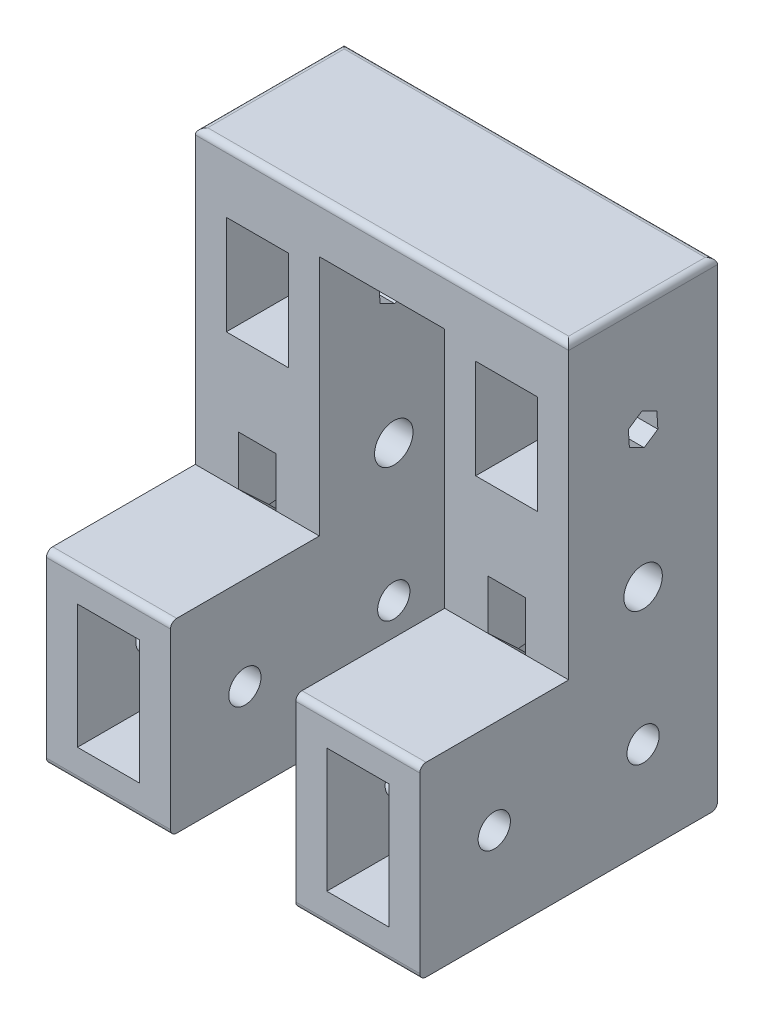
ISO-10303-21;
HEADER;
FILE_DESCRIPTION(('STEP AP214'),'2;1');
FILE_NAME('part.step','',(''),(''),'','','');
FILE_SCHEMA(('AUTOMOTIVE_DESIGN { 1 0 10303 214 1 1 1 1 }'));
ENDSEC;
DATA;
#1=APPLICATION_CONTEXT('core data for automotive mechanical design processes');
#2=APPLICATION_PROTOCOL_DEFINITION('international standard','automotive_design',2000,#1);
#3=PRODUCT_CONTEXT('',#1,'mechanical');
#4=PRODUCT('Part','Part','',(#3));
#5=PRODUCT_RELATED_PRODUCT_CATEGORY('part','',(#4));
#6=PRODUCT_DEFINITION_FORMATION('','',#4);
#7=PRODUCT_DEFINITION_CONTEXT('part definition',#1,'design');
#8=PRODUCT_DEFINITION('design','',#6,#7);
#9=PRODUCT_DEFINITION_SHAPE('','',#8);
#10=(LENGTH_UNIT() NAMED_UNIT(*) SI_UNIT(.MILLI.,.METRE.));
#11=(NAMED_UNIT(*) PLANE_ANGLE_UNIT() SI_UNIT($,.RADIAN.));
#12=(NAMED_UNIT(*) SI_UNIT($,.STERADIAN.) SOLID_ANGLE_UNIT());
#13=UNCERTAINTY_MEASURE_WITH_UNIT(LENGTH_MEASURE(1.E-05),#10,'distance_accuracy_value','');
#14=(GEOMETRIC_REPRESENTATION_CONTEXT(3) GLOBAL_UNCERTAINTY_ASSIGNED_CONTEXT((#13)) GLOBAL_UNIT_ASSIGNED_CONTEXT((#10,
#11,#12)) REPRESENTATION_CONTEXT('',''));
#15=CARTESIAN_POINT('',(0.,0.,0.));
#16=DIRECTION('',(0.,0.,1.));
#17=DIRECTION('',(1.,0.,0.));
#18=AXIS2_PLACEMENT_3D('',#15,#16,#17);
#19=CARTESIAN_POINT('',(30.1,-31.7957746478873,-26.6514084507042));
#20=DIRECTION('',(0.,0.,1.));
#21=DIRECTION('',(0.,-1.,0.));
#22=AXIS2_PLACEMENT_3D('',#19,#20,#21);
#23=PLANE('',#22);
#24=DIRECTION('',(-1.,0.,0.));
#25=VECTOR('',#24,1.);
#26=CARTESIAN_POINT('',(15.1,-26.7957746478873,-26.6514084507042));
#27=LINE('',#26,#25);
#28=CARTESIAN_POINT('',(25.1,-26.7957746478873,-26.6514084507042));
#29=VERTEX_POINT('',#28);
#30=CARTESIAN_POINT('',(15.1,-26.7957746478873,-26.6514084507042));
#31=VERTEX_POINT('',#30);
#32=EDGE_CURVE('E529',#29,#31,#27,.T.);
#33=ORIENTED_EDGE('',*,*,#32,.F.);
#34=DIRECTION('',(0.,-1.,0.));
#35=VECTOR('',#34,1.);
#36=CARTESIAN_POINT('',(25.1,-24.2957746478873,-26.6514084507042));
#37=LINE('',#36,#35);
#38=CARTESIAN_POINT('',(25.1,-6.79577464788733,-26.6514084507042));
#39=VERTEX_POINT('',#38);
#40=EDGE_CURVE('E628',#39,#29,#37,.T.);
#41=ORIENTED_EDGE('',*,*,#40,.F.);
#42=DIRECTION('',(1.,0.,0.));
#43=VECTOR('',#42,1.);
#44=CARTESIAN_POINT('',(15.1,-6.79577464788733,-26.6514084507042));
#45=LINE('',#44,#43);
#46=CARTESIAN_POINT('',(15.1,-6.79577464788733,-26.6514084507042));
#47=VERTEX_POINT('',#46);
#48=EDGE_CURVE('E556',#47,#39,#45,.T.);
#49=ORIENTED_EDGE('',*,*,#48,.F.);
#50=DIRECTION('',(0.,1.,0.));
#51=VECTOR('',#50,1.);
#52=CARTESIAN_POINT('',(15.1,-24.2957746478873,-26.6514084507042));
#53=LINE('',#52,#51);
#54=EDGE_CURVE('E637',#31,#47,#53,.T.);
#55=ORIENTED_EDGE('',*,*,#54,.F.);
#56=EDGE_LOOP('',(#33,#41,#49,#55));
#57=FACE_BOUND('',#56,.T.);
#58=DIRECTION('',(0.,-1.,0.));
#59=VECTOR('',#58,1.);
#60=CARTESIAN_POINT('',(-25.1,35.2042253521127,-26.6514084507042));
#61=LINE('',#60,#59);
#62=CARTESIAN_POINT('',(-25.1,35.2042253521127,-26.6514084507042));
#63=VERTEX_POINT('',#62);
#64=CARTESIAN_POINT('',(-25.1,19.2042253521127,-26.6514084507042));
#65=VERTEX_POINT('',#64);
#66=EDGE_CURVE('E905',#63,#65,#61,.T.);
#67=ORIENTED_EDGE('',*,*,#66,.T.);
#68=DIRECTION('',(1.,0.,0.));
#69=VECTOR('',#68,1.);
#70=CARTESIAN_POINT('',(-25.1,19.2042253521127,-26.6514084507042));
#71=LINE('',#70,#69);
#72=CARTESIAN_POINT('',(-15.1,19.2042253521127,-26.6514084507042));
#73=VERTEX_POINT('',#72);
#74=EDGE_CURVE('E888',#65,#73,#71,.T.);
#75=ORIENTED_EDGE('',*,*,#74,.T.);
#76=DIRECTION('',(0.,-1.,0.));
#77=VECTOR('',#76,1.);
#78=CARTESIAN_POINT('',(-15.1,35.2042253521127,-26.6514084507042));
#79=LINE('',#78,#77);
#80=CARTESIAN_POINT('',(-15.1,35.2042253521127,-26.6514084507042));
#81=VERTEX_POINT('',#80);
#82=EDGE_CURVE('E892',#81,#73,#79,.T.);
#83=ORIENTED_EDGE('',*,*,#82,.F.);
#84=DIRECTION('',(1.,0.,0.));
#85=VECTOR('',#84,1.);
#86=CARTESIAN_POINT('',(-25.1,35.2042253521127,-26.6514084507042));
#87=LINE('',#86,#85);
#88=EDGE_CURVE('E900',#63,#81,#87,.T.);
#89=ORIENTED_EDGE('',*,*,#88,.F.);
#90=EDGE_LOOP('',(#67,#75,#83,#89));
#91=FACE_BOUND('',#90,.T.);
#92=DIRECTION('',(0.,-1.,0.));
#93=VECTOR('',#92,1.);
#94=CARTESIAN_POINT('',(15.1,35.2042253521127,-26.6514084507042));
#95=LINE('',#94,#93);
#96=CARTESIAN_POINT('',(15.1,35.2042253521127,-26.6514084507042));
#97=VERTEX_POINT('',#96);
#98=CARTESIAN_POINT('',(15.1,19.2042253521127,-26.6514084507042));
#99=VERTEX_POINT('',#98);
#100=EDGE_CURVE('E939',#97,#99,#95,.T.);
#101=ORIENTED_EDGE('',*,*,#100,.T.);
#102=DIRECTION('',(1.,0.,0.));
#103=VECTOR('',#102,1.);
#104=CARTESIAN_POINT('',(15.1,19.2042253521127,-26.6514084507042));
#105=LINE('',#104,#103);
#106=CARTESIAN_POINT('',(25.1,19.2042253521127,-26.6514084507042));
#107=VERTEX_POINT('',#106);
#108=EDGE_CURVE('E954',#99,#107,#105,.T.);
#109=ORIENTED_EDGE('',*,*,#108,.T.);
#110=DIRECTION('',(0.,-1.,0.));
#111=VECTOR('',#110,1.);
#112=CARTESIAN_POINT('',(25.1,35.2042253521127,-26.6514084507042));
#113=LINE('',#112,#111);
#114=CARTESIAN_POINT('',(25.1,35.2042253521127,-26.6514084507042));
#115=VERTEX_POINT('',#114);
#116=EDGE_CURVE('E971',#115,#107,#113,.T.);
#117=ORIENTED_EDGE('',*,*,#116,.F.);
#118=DIRECTION('',(1.,0.,0.));
#119=VECTOR('',#118,1.);
#120=CARTESIAN_POINT('',(15.1,35.2042253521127,-26.6514084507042));
#121=LINE('',#120,#119);
#122=EDGE_CURVE('E968',#97,#115,#121,.T.);
#123=ORIENTED_EDGE('',*,*,#122,.F.);
#124=EDGE_LOOP('',(#101,#109,#117,#123));
#125=FACE_BOUND('',#124,.T.);
#126=DIRECTION('',(0.,1.,0.));
#127=VECTOR('',#126,1.);
#128=CARTESIAN_POINT('',(-30.1,-31.7957746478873,-26.6514084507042));
#129=LINE('',#128,#127);
#130=CARTESIAN_POINT('',(-30.1,-30.7957746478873,-26.6514084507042));
#131=VERTEX_POINT('',#130);
#132=CARTESIAN_POINT('',(-30.1,44.2042253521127,-26.6514084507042));
#133=VERTEX_POINT('',#132);
#134=EDGE_CURVE('E790',#131,#133,#129,.T.);
#135=ORIENTED_EDGE('',*,*,#134,.T.);
#136=DIRECTION('',(-1.,0.,0.));
#137=VECTOR('',#136,1.);
#138=CARTESIAN_POINT('',(30.1,44.2042253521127,-26.6514084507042));
#139=LINE('',#138,#137);
#140=CARTESIAN_POINT('',(30.1,44.2042253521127,-26.6514084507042));
#141=VERTEX_POINT('',#140);
#142=EDGE_CURVE('E669',#133,#141,#139,.F.);
#143=ORIENTED_EDGE('',*,*,#142,.T.);
#144=DIRECTION('',(0.,1.,0.));
#145=VECTOR('',#144,1.);
#146=CARTESIAN_POINT('',(30.1,-31.7957746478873,-26.6514084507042));
#147=LINE('',#146,#145);
#148=CARTESIAN_POINT('',(30.1,-30.7957746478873,-26.6514084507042));
#149=VERTEX_POINT('',#148);
#150=EDGE_CURVE('E1286',#149,#141,#147,.T.);
#151=ORIENTED_EDGE('',*,*,#150,.F.);
#152=DIRECTION('',(-1.,0.,0.));
#153=VECTOR('',#152,1.);
#154=CARTESIAN_POINT('',(30.1,-30.7957746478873,-26.6514084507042));
#155=LINE('',#154,#153);
#156=CARTESIAN_POINT('',(10.1,-30.7957746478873,-26.6514084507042));
#157=VERTEX_POINT('',#156);
#158=EDGE_CURVE('E665',#149,#157,#155,.T.);
#159=ORIENTED_EDGE('',*,*,#158,.T.);
#160=DIRECTION('',(0.,-1.,0.));
#161=VECTOR('',#160,1.);
#162=CARTESIAN_POINT('',(10.1,37.2042253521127,-26.6514084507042));
#163=LINE('',#162,#161);
#164=CARTESIAN_POINT('',(10.1,37.2042253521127,-26.6514084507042));
#165=VERTEX_POINT('',#164);
#166=EDGE_CURVE('E1081',#165,#157,#163,.T.);
#167=ORIENTED_EDGE('',*,*,#166,.F.);
#168=DIRECTION('',(1.,0.,0.));
#169=VECTOR('',#168,1.);
#170=CARTESIAN_POINT('',(-10.1,37.2042253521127,-26.6514084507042));
#171=LINE('',#170,#169);
#172=CARTESIAN_POINT('',(-10.1,37.2042253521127,-26.6514084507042));
#173=VERTEX_POINT('',#172);
#174=EDGE_CURVE('E1056',#173,#165,#171,.T.);
#175=ORIENTED_EDGE('',*,*,#174,.F.);
#176=DIRECTION('',(0.,-1.,0.));
#177=VECTOR('',#176,1.);
#178=CARTESIAN_POINT('',(-10.1,37.2042253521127,-26.6514084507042));
#179=LINE('',#178,#177);
#180=CARTESIAN_POINT('',(-10.1,-30.7957746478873,-26.6514084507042));
#181=VERTEX_POINT('',#180);
#182=EDGE_CURVE('E1070',#173,#181,#179,.T.);
#183=ORIENTED_EDGE('',*,*,#182,.T.);
#184=DIRECTION('',(-1.,0.,0.));
#185=VECTOR('',#184,1.);
#186=CARTESIAN_POINT('',(30.1,-30.7957746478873,-26.6514084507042));
#187=LINE('',#186,#185);
#188=EDGE_CURVE('E666',#181,#131,#187,.T.);
#189=ORIENTED_EDGE('',*,*,#188,.T.);
#190=EDGE_LOOP('',(#135,#143,#151,#159,#167,#175,#183,#189));
#191=FACE_BOUND('',#190,.T.);
#192=DIRECTION('',(-1.,0.,0.));
#193=VECTOR('',#192,1.);
#194=CARTESIAN_POINT('',(-25.1,-26.7957746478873,-26.6514084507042));
#195=LINE('',#194,#193);
#196=CARTESIAN_POINT('',(-15.1,-26.7957746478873,-26.6514084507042));
#197=VERTEX_POINT('',#196);
#198=CARTESIAN_POINT('',(-25.1,-26.7957746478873,-26.6514084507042));
#199=VERTEX_POINT('',#198);
#200=EDGE_CURVE('E524',#197,#199,#195,.T.);
#201=ORIENTED_EDGE('',*,*,#200,.F.);
#202=DIRECTION('',(0.,-1.,0.));
#203=VECTOR('',#202,1.);
#204=CARTESIAN_POINT('',(-15.1,-24.2957746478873,-26.6514084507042));
#205=LINE('',#204,#203);
#206=CARTESIAN_POINT('',(-15.1,-6.79577464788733,-26.6514084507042));
#207=VERTEX_POINT('',#206);
#208=EDGE_CURVE('E494',#207,#197,#205,.T.);
#209=ORIENTED_EDGE('',*,*,#208,.F.);
#210=DIRECTION('',(1.,0.,0.));
#211=VECTOR('',#210,1.);
#212=CARTESIAN_POINT('',(-25.1,-6.79577464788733,-26.6514084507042));
#213=LINE('',#212,#211);
#214=CARTESIAN_POINT('',(-25.1,-6.79577464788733,-26.6514084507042));
#215=VERTEX_POINT('',#214);
#216=EDGE_CURVE('E520',#215,#207,#213,.T.);
#217=ORIENTED_EDGE('',*,*,#216,.F.);
#218=DIRECTION('',(0.,1.,0.));
#219=VECTOR('',#218,1.);
#220=CARTESIAN_POINT('',(-25.1,-24.2957746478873,-26.6514084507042));
#221=LINE('',#220,#219);
#222=EDGE_CURVE('E947',#199,#215,#221,.T.);
#223=ORIENTED_EDGE('',*,*,#222,.F.);
#224=EDGE_LOOP('',(#201,#209,#217,#223));
#225=FACE_BOUND('',#224,.T.);
#226=ADVANCED_FACE('F59',(#57,#91,#125,#191,#225),#23,.F.);
#227=CARTESIAN_POINT('',(-30.1,-16.7957746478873,-14.6514084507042));
#228=DIRECTION('',(1.,0.,0.));
#229=DIRECTION('',(0.,0.,-1.));
#230=AXIS2_PLACEMENT_3D('',#227,#228,#229);
#231=CYLINDRICAL_SURFACE('',#230,2.6);
#232=CARTESIAN_POINT('',(-15.1,-16.7957746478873,-14.6514084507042));
#233=DIRECTION('',(1.,0.,0.));
#234=DIRECTION('',(0.,0.,-1.));
#235=AXIS2_PLACEMENT_3D('',#232,#233,#234);
#236=CIRCLE('',#235,2.6);
#237=CARTESIAN_POINT('',(-15.1,-16.7957746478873,-17.2514084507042));
#238=VERTEX_POINT('',#237);
#239=EDGE_CURVE('E622',#238,#238,#236,.F.);
#240=ORIENTED_EDGE('',*,*,#239,.T.);
#241=EDGE_LOOP('',(#240));
#242=FACE_BOUND('',#241,.T.);
#243=CARTESIAN_POINT('',(-10.1,-16.7957746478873,-14.6514084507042));
#244=DIRECTION('',(-1.,0.,0.));
#245=DIRECTION('',(0.,0.,1.));
#246=AXIS2_PLACEMENT_3D('',#243,#244,#245);
#247=CIRCLE('',#246,2.6);
#248=CARTESIAN_POINT('',(-10.1,-16.7957746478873,-12.0514084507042));
#249=VERTEX_POINT('',#248);
#250=EDGE_CURVE('E1158',#249,#249,#247,.F.);
#251=ORIENTED_EDGE('',*,*,#250,.T.);
#252=EDGE_LOOP('',(#251));
#253=FACE_BOUND('',#252,.T.);
#254=ADVANCED_FACE('F1470',(#242,#253),#231,.F.);
#255=CARTESIAN_POINT('',(-30.1,-16.7957746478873,9.34859154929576));
#256=DIRECTION('',(1.,0.,0.));
#257=DIRECTION('',(0.,0.,-1.));
#258=AXIS2_PLACEMENT_3D('',#255,#256,#257);
#259=CYLINDRICAL_SURFACE('',#258,2.6);
#260=CARTESIAN_POINT('',(-15.1,-16.7957746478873,9.34859154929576));
#261=DIRECTION('',(1.,0.,0.));
#262=DIRECTION('',(0.,0.,-1.));
#263=AXIS2_PLACEMENT_3D('',#260,#261,#262);
#264=CIRCLE('',#263,2.6);
#265=CARTESIAN_POINT('',(-15.1,-16.7957746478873,6.74859154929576));
#266=VERTEX_POINT('',#265);
#267=EDGE_CURVE('E624',#266,#266,#264,.F.);
#268=ORIENTED_EDGE('',*,*,#267,.T.);
#269=EDGE_LOOP('',(#268));
#270=FACE_BOUND('',#269,.T.);
#271=CARTESIAN_POINT('',(-10.1,-16.7957746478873,9.34859154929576));
#272=DIRECTION('',(-1.,0.,0.));
#273=DIRECTION('',(0.,0.,1.));
#274=AXIS2_PLACEMENT_3D('',#271,#272,#273);
#275=CIRCLE('',#274,2.6);
#276=CARTESIAN_POINT('',(-10.1,-16.7957746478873,11.9485915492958));
#277=VERTEX_POINT('',#276);
#278=EDGE_CURVE('E1150',#277,#277,#275,.F.);
#279=ORIENTED_EDGE('',*,*,#278,.T.);
#280=EDGE_LOOP('',(#279));
#281=FACE_BOUND('',#280,.T.);
#282=ADVANCED_FACE('F1473',(#270,#281),#259,.F.);
#283=CARTESIAN_POINT('',(25.1,-16.7957746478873,-14.6514084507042));
#284=DIRECTION('',(1.,0.,0.));
#285=DIRECTION('',(0.,0.,-1.));
#286=AXIS2_PLACEMENT_3D('',#283,#284,#285);
#287=CIRCLE('',#286,2.6);
#288=CARTESIAN_POINT('',(25.1,-16.7957746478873,-17.2514084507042));
#289=VERTEX_POINT('',#288);
#290=EDGE_CURVE('E597',#289,#289,#287,.F.);
#291=ORIENTED_EDGE('',*,*,#290,.T.);
#292=EDGE_LOOP('',(#291));
#293=FACE_BOUND('',#292,.T.);
#294=CARTESIAN_POINT('',(30.1,-16.7957746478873,-14.6514084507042));
#295=DIRECTION('',(1.,0.,0.));
#296=DIRECTION('',(0.,0.,-1.));
#297=AXIS2_PLACEMENT_3D('',#294,#295,#296);
#298=CIRCLE('',#297,2.6);
#299=CARTESIAN_POINT('',(30.1,-16.7957746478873,-17.2514084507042));
#300=VERTEX_POINT('',#299);
#301=EDGE_CURVE('E1175',#300,#300,#298,.T.);
#302=ORIENTED_EDGE('',*,*,#301,.T.);
#303=EDGE_LOOP('',(#302));
#304=FACE_BOUND('',#303,.T.);
#305=ADVANCED_FACE('F1476',(#293,#304),#231,.F.);
#306=CARTESIAN_POINT('',(25.1,-16.7957746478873,9.34859154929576));
#307=DIRECTION('',(1.,0.,0.));
#308=DIRECTION('',(0.,0.,-1.));
#309=AXIS2_PLACEMENT_3D('',#306,#307,#308);
#310=CIRCLE('',#309,2.6);
#311=CARTESIAN_POINT('',(25.1,-16.7957746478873,6.74859154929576));
#312=VERTEX_POINT('',#311);
#313=EDGE_CURVE('E599',#312,#312,#310,.F.);
#314=ORIENTED_EDGE('',*,*,#313,.T.);
#315=EDGE_LOOP('',(#314));
#316=FACE_BOUND('',#315,.T.);
#317=CARTESIAN_POINT('',(30.1,-16.7957746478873,9.34859154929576));
#318=DIRECTION('',(1.,0.,0.));
#319=DIRECTION('',(0.,0.,-1.));
#320=AXIS2_PLACEMENT_3D('',#317,#318,#319);
#321=CIRCLE('',#320,2.6);
#322=CARTESIAN_POINT('',(30.1,-16.7957746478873,6.74859154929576));
#323=VERTEX_POINT('',#322);
#324=EDGE_CURVE('E1180',#323,#323,#321,.T.);
#325=ORIENTED_EDGE('',*,*,#324,.T.);
#326=EDGE_LOOP('',(#325));
#327=FACE_BOUND('',#326,.T.);
#328=ADVANCED_FACE('F843',(#316,#327),#259,.F.);
#329=CARTESIAN_POINT('',(30.1,45.2042253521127,-2.65140845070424));
#330=DIRECTION('',(0.,0.,-1.));
#331=DIRECTION('',(0.,1.,0.));
#332=AXIS2_PLACEMENT_3D('',#329,#330,#331);
#333=PLANE('',#332);
#334=DIRECTION('',(0.,-1.,0.));
#335=VECTOR('',#334,1.);
#336=CARTESIAN_POINT('',(-15.1,35.2042253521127,-2.65140845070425));
#337=LINE('',#336,#335);
#338=CARTESIAN_POINT('',(-15.1,35.2042253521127,-2.65140845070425));
#339=VERTEX_POINT('',#338);
#340=CARTESIAN_POINT('',(-15.1,19.2042253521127,-2.65140845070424));
#341=VERTEX_POINT('',#340);
#342=EDGE_CURVE('E908',#339,#341,#337,.T.);
#343=ORIENTED_EDGE('',*,*,#342,.T.);
#344=DIRECTION('',(1.,0.,0.));
#345=VECTOR('',#344,1.);
#346=CARTESIAN_POINT('',(-25.1,19.2042253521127,-2.65140845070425));
#347=LINE('',#346,#345);
#348=CARTESIAN_POINT('',(-25.1,19.2042253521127,-2.65140845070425));
#349=VERTEX_POINT('',#348);
#350=EDGE_CURVE('E910',#349,#341,#347,.T.);
#351=ORIENTED_EDGE('',*,*,#350,.F.);
#352=DIRECTION('',(0.,-1.,0.));
#353=VECTOR('',#352,1.);
#354=CARTESIAN_POINT('',(-25.1,35.2042253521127,-2.65140845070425));
#355=LINE('',#354,#353);
#356=CARTESIAN_POINT('',(-25.1,35.2042253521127,-2.65140845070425));
#357=VERTEX_POINT('',#356);
#358=EDGE_CURVE('E894',#357,#349,#355,.T.);
#359=ORIENTED_EDGE('',*,*,#358,.F.);
#360=DIRECTION('',(1.,0.,0.));
#361=VECTOR('',#360,1.);
#362=CARTESIAN_POINT('',(-25.1,35.2042253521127,-2.65140845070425));
#363=LINE('',#362,#361);
#364=EDGE_CURVE('E913',#357,#339,#363,.T.);
#365=ORIENTED_EDGE('',*,*,#364,.T.);
#366=EDGE_LOOP('',(#343,#351,#359,#365));
#367=FACE_BOUND('',#366,.T.);
#368=DIRECTION('',(0.,-1.,0.));
#369=VECTOR('',#368,1.);
#370=CARTESIAN_POINT('',(25.1,35.2042253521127,-2.65140845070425));
#371=LINE('',#370,#369);
#372=CARTESIAN_POINT('',(25.1,35.2042253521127,-2.65140845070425));
#373=VERTEX_POINT('',#372);
#374=CARTESIAN_POINT('',(25.1,19.2042253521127,-2.65140845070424));
#375=VERTEX_POINT('',#374);
#376=EDGE_CURVE('E956',#373,#375,#371,.T.);
#377=ORIENTED_EDGE('',*,*,#376,.T.);
#378=DIRECTION('',(1.,0.,0.));
#379=VECTOR('',#378,1.);
#380=CARTESIAN_POINT('',(15.1,19.2042253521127,-2.65140845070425));
#381=LINE('',#380,#379);
#382=CARTESIAN_POINT('',(15.1,19.2042253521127,-2.65140845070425));
#383=VERTEX_POINT('',#382);
#384=EDGE_CURVE('E912',#383,#375,#381,.T.);
#385=ORIENTED_EDGE('',*,*,#384,.F.);
#386=DIRECTION('',(0.,-1.,0.));
#387=VECTOR('',#386,1.);
#388=CARTESIAN_POINT('',(15.1,35.2042253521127,-2.65140845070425));
#389=LINE('',#388,#387);
#390=CARTESIAN_POINT('',(15.1,35.2042253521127,-2.65140845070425));
#391=VERTEX_POINT('',#390);
#392=EDGE_CURVE('E949',#391,#383,#389,.T.);
#393=ORIENTED_EDGE('',*,*,#392,.F.);
#394=DIRECTION('',(1.,0.,0.));
#395=VECTOR('',#394,1.);
#396=CARTESIAN_POINT('',(15.1,35.2042253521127,-2.65140845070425));
#397=LINE('',#396,#395);
#398=EDGE_CURVE('E953',#391,#373,#397,.T.);
#399=ORIENTED_EDGE('',*,*,#398,.T.);
#400=EDGE_LOOP('',(#377,#385,#393,#399));
#401=FACE_BOUND('',#400,.T.);
#402=DIRECTION('',(0.,-1.,0.));
#403=VECTOR('',#402,1.);
#404=CARTESIAN_POINT('',(30.1,45.2042253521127,-2.65140845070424));
#405=LINE('',#404,#403);
#406=CARTESIAN_POINT('',(30.1,44.2042253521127,-2.65140845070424));
#407=VERTEX_POINT('',#406);
#408=CARTESIAN_POINT('',(30.1,-1.79577464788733,-2.65140845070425));
#409=VERTEX_POINT('',#408);
#410=EDGE_CURVE('E779',#407,#409,#405,.T.);
#411=ORIENTED_EDGE('',*,*,#410,.F.);
#412=DIRECTION('',(-1.,0.,0.));
#413=VECTOR('',#412,1.);
#414=CARTESIAN_POINT('',(30.1,44.2042253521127,-2.65140845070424));
#415=LINE('',#414,#413);
#416=CARTESIAN_POINT('',(-30.1,44.2042253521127,-2.65140845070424));
#417=VERTEX_POINT('',#416);
#418=EDGE_CURVE('E687',#407,#417,#415,.T.);
#419=ORIENTED_EDGE('',*,*,#418,.T.);
#420=DIRECTION('',(0.,-1.,0.));
#421=VECTOR('',#420,1.);
#422=CARTESIAN_POINT('',(-30.1,45.2042253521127,-2.65140845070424));
#423=LINE('',#422,#421);
#424=CARTESIAN_POINT('',(-30.1,-1.79577464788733,-2.65140845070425));
#425=VERTEX_POINT('',#424);
#426=EDGE_CURVE('E772',#417,#425,#423,.T.);
#427=ORIENTED_EDGE('',*,*,#426,.T.);
#428=DIRECTION('',(-1.,0.,0.));
#429=VECTOR('',#428,1.);
#430=CARTESIAN_POINT('',(30.1,-1.79577464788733,-2.65140845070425));
#431=LINE('',#430,#429);
#432=CARTESIAN_POINT('',(-23.1,-1.79577464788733,-2.65140845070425));
#433=VERTEX_POINT('',#432);
#434=EDGE_CURVE('E803',#433,#425,#431,.T.);
#435=ORIENTED_EDGE('',*,*,#434,.F.);
#436=DIRECTION('',(0.,-1.,0.));
#437=VECTOR('',#436,1.);
#438=CARTESIAN_POINT('',(-23.1,-1.79577464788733,-2.65140845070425));
#439=LINE('',#438,#437);
#440=CARTESIAN_POINT('',(-23.1,6.20422535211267,-2.65140845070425));
#441=VERTEX_POINT('',#440);
#442=EDGE_CURVE('E884',#441,#433,#439,.T.);
#443=ORIENTED_EDGE('',*,*,#442,.F.);
#444=DIRECTION('',(-1.,0.,0.));
#445=VECTOR('',#444,1.);
#446=CARTESIAN_POINT('',(-23.1,6.20422535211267,-2.65140845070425));
#447=LINE('',#446,#445);
#448=CARTESIAN_POINT('',(-17.1,6.20422535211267,-2.65140845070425));
#449=VERTEX_POINT('',#448);
#450=EDGE_CURVE('E880',#449,#441,#447,.T.);
#451=ORIENTED_EDGE('',*,*,#450,.F.);
#452=DIRECTION('',(0.,1.,0.));
#453=VECTOR('',#452,1.);
#454=CARTESIAN_POINT('',(-17.1,-1.79577464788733,-2.65140845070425));
#455=LINE('',#454,#453);
#456=CARTESIAN_POINT('',(-17.1,-1.79577464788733,-2.65140845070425));
#457=VERTEX_POINT('',#456);
#458=EDGE_CURVE('E867',#457,#449,#455,.T.);
#459=ORIENTED_EDGE('',*,*,#458,.F.);
#460=CARTESIAN_POINT('',(-10.1,-1.79577464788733,-2.65140845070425));
#461=VERTEX_POINT('',#460);
#462=EDGE_CURVE('E806',#461,#457,#431,.T.);
#463=ORIENTED_EDGE('',*,*,#462,.F.);
#464=DIRECTION('',(0.,1.,0.));
#465=VECTOR('',#464,1.);
#466=CARTESIAN_POINT('',(-10.1,45.2042253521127,-2.65140845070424));
#467=LINE('',#466,#465);
#468=CARTESIAN_POINT('',(-10.1,37.2042253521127,-2.65140845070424));
#469=VERTEX_POINT('',#468);
#470=EDGE_CURVE('E1161',#461,#469,#467,.T.);
#471=ORIENTED_EDGE('',*,*,#470,.T.);
#472=DIRECTION('',(-1.,0.,0.));
#473=VECTOR('',#472,1.);
#474=CARTESIAN_POINT('',(30.1,37.2042253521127,-2.65140845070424));
#475=LINE('',#474,#473);
#476=CARTESIAN_POINT('',(10.1,37.2042253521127,-2.65140845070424));
#477=VERTEX_POINT('',#476);
#478=EDGE_CURVE('E1322',#477,#469,#475,.T.);
#479=ORIENTED_EDGE('',*,*,#478,.F.);
#480=DIRECTION('',(0.,-1.,0.));
#481=VECTOR('',#480,1.);
#482=CARTESIAN_POINT('',(10.1,45.2042253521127,-2.65140845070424));
#483=LINE('',#482,#481);
#484=CARTESIAN_POINT('',(10.1,-1.79577464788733,-2.65140845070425));
#485=VERTEX_POINT('',#484);
#486=EDGE_CURVE('E1123',#477,#485,#483,.T.);
#487=ORIENTED_EDGE('',*,*,#486,.T.);
#488=CARTESIAN_POINT('',(17.1,-1.79577464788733,-2.65140845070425));
#489=VERTEX_POINT('',#488);
#490=EDGE_CURVE('E816',#489,#485,#431,.T.);
#491=ORIENTED_EDGE('',*,*,#490,.F.);
#492=DIRECTION('',(0.,-1.,0.));
#493=VECTOR('',#492,1.);
#494=CARTESIAN_POINT('',(17.1,-1.79577464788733,-2.65140845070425));
#495=LINE('',#494,#493);
#496=CARTESIAN_POINT('',(17.1,6.20422535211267,-2.65140845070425));
#497=VERTEX_POINT('',#496);
#498=EDGE_CURVE('E1367',#497,#489,#495,.T.);
#499=ORIENTED_EDGE('',*,*,#498,.F.);
#500=DIRECTION('',(-1.,0.,0.));
#501=VECTOR('',#500,1.);
#502=CARTESIAN_POINT('',(17.1,6.20422535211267,-2.65140845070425));
#503=LINE('',#502,#501);
#504=CARTESIAN_POINT('',(23.1,6.20422535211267,-2.65140845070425));
#505=VERTEX_POINT('',#504);
#506=EDGE_CURVE('E828',#505,#497,#503,.T.);
#507=ORIENTED_EDGE('',*,*,#506,.F.);
#508=DIRECTION('',(0.,1.,0.));
#509=VECTOR('',#508,1.);
#510=CARTESIAN_POINT('',(23.1,-1.79577464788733,-2.65140845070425));
#511=LINE('',#510,#509);
#512=CARTESIAN_POINT('',(23.1,-1.79577464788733,-2.65140845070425));
#513=VERTEX_POINT('',#512);
#514=EDGE_CURVE('E1345',#513,#505,#511,.T.);
#515=ORIENTED_EDGE('',*,*,#514,.F.);
#516=EDGE_CURVE('E815',#409,#513,#431,.T.);
#517=ORIENTED_EDGE('',*,*,#516,.F.);
#518=EDGE_LOOP('',(#411,#419,#427,#435,#443,#451,#459,#463,#471,#479,#487,#491,#499,#507,#515,#517));
#519=FACE_BOUND('',#518,.T.);
#520=ADVANCED_FACE('F775',(#367,#401,#519),#333,.F.);
#521=CARTESIAN_POINT('',(-30.1,26.0217696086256,-17.0294605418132));
#522=DIRECTION('',(0.,0.0621238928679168,-0.998068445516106));
#523=DIRECTION('',(0.,0.998068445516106,0.0621238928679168));
#524=AXIS2_PLACEMENT_3D('',#521,#522,#523);
#525=PLANE('',#524);
#526=DIRECTION('',(0.,0.998068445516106,0.0621238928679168));
#527=VECTOR('',#526,1.);
#528=CARTESIAN_POINT('',(-15.1,26.0217696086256,-17.0294605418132));
#529=LINE('',#528,#527);
#530=CARTESIAN_POINT('',(-15.1,26.0217696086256,-17.0294605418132));
#531=VERTEX_POINT('',#530);
#532=CARTESIAN_POINT('',(-15.1,28.6724510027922,-16.8644712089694));
#533=VERTEX_POINT('',#532);
#534=EDGE_CURVE('E1030',#531,#533,#529,.T.);
#535=ORIENTED_EDGE('',*,*,#534,.F.);
#536=DIRECTION('',(1.,0.,0.));
#537=VECTOR('',#536,1.);
#538=CARTESIAN_POINT('',(-30.1,26.0217696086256,-17.0294605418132));
#539=LINE('',#538,#537);
#540=CARTESIAN_POINT('',(-10.1,26.0217696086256,-17.0294605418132));
#541=VERTEX_POINT('',#540);
#542=EDGE_CURVE('E1226',#531,#541,#539,.T.);
#543=ORIENTED_EDGE('',*,*,#542,.T.);
#544=DIRECTION('',(0.,0.998068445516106,0.0621238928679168));
#545=VECTOR('',#544,1.);
#546=CARTESIAN_POINT('',(-10.1,26.0217696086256,-17.0294605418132));
#547=LINE('',#546,#545);
#548=CARTESIAN_POINT('',(-10.1,28.6724510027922,-16.8644712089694));
#549=VERTEX_POINT('',#548);
#550=EDGE_CURVE('E1142',#541,#549,#547,.T.);
#551=ORIENTED_EDGE('',*,*,#550,.T.);
#552=DIRECTION('',(1.,0.,0.));
#553=VECTOR('',#552,1.);
#554=CARTESIAN_POINT('',(-30.1,28.6724510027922,-16.8644712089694));
#555=LINE('',#554,#553);
#556=EDGE_CURVE('E1191',#533,#549,#555,.T.);
#557=ORIENTED_EDGE('',*,*,#556,.F.);
#558=EDGE_LOOP('',(#535,#543,#551,#557));
#559=FACE_BOUND('',#558,.T.);
#560=ADVANCED_FACE('F845',(#559),#525,.F.);
#561=CARTESIAN_POINT('',(-30.1,24.553543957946,-14.8163977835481));
#562=DIRECTION('',(0.,-0.833290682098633,-0.552835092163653));
#563=DIRECTION('',(0.,0.552835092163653,-0.833290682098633));
#564=AXIS2_PLACEMENT_3D('',#561,#562,#563);
#565=PLANE('',#564);
#566=DIRECTION('',(0.,0.552835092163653,-0.833290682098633));
#567=VECTOR('',#566,1.);
#568=CARTESIAN_POINT('',(-15.1,24.553543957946,-14.8163977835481));
#569=LINE('',#568,#567);
#570=CARTESIAN_POINT('',(-15.1,24.553543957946,-14.8163977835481));
#571=VERTEX_POINT('',#570);
#572=EDGE_CURVE('E1022',#571,#531,#569,.T.);
#573=ORIENTED_EDGE('',*,*,#572,.F.);
#574=DIRECTION('',(1.,0.,0.));
#575=VECTOR('',#574,1.);
#576=CARTESIAN_POINT('',(-30.1,24.553543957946,-14.8163977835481));
#577=LINE('',#576,#575);
#578=CARTESIAN_POINT('',(-10.1,24.553543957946,-14.8163977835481));
#579=VERTEX_POINT('',#578);
#580=EDGE_CURVE('E1217',#571,#579,#577,.T.);
#581=ORIENTED_EDGE('',*,*,#580,.T.);
#582=DIRECTION('',(0.,0.552835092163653,-0.833290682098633));
#583=VECTOR('',#582,1.);
#584=CARTESIAN_POINT('',(-10.1,24.553543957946,-14.8163977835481));
#585=LINE('',#584,#583);
#586=EDGE_CURVE('E1138',#579,#541,#585,.T.);
#587=ORIENTED_EDGE('',*,*,#586,.T.);
#588=ORIENTED_EDGE('',*,*,#542,.F.);
#589=EDGE_LOOP('',(#573,#581,#587,#588));
#590=FACE_BOUND('',#589,.T.);
#591=ADVANCED_FACE('F1860',(#590),#565,.F.);
#592=CARTESIAN_POINT('',(-30.1,25.7359997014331,-12.4383456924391));
#593=DIRECTION('',(0.,-0.895414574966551,0.445233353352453));
#594=DIRECTION('',(0.,-0.445233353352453,-0.895414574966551));
#595=AXIS2_PLACEMENT_3D('',#592,#593,#594);
#596=PLANE('',#595);
#597=DIRECTION('',(0.,-0.445233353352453,-0.895414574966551));
#598=VECTOR('',#597,1.);
#599=CARTESIAN_POINT('',(-15.1,25.7359997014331,-12.4383456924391));
#600=LINE('',#599,#598);
#601=CARTESIAN_POINT('',(-15.1,25.7359997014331,-12.4383456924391));
#602=VERTEX_POINT('',#601);
#603=EDGE_CURVE('E1021',#602,#571,#600,.T.);
#604=ORIENTED_EDGE('',*,*,#603,.F.);
#605=DIRECTION('',(1.,0.,0.));
#606=VECTOR('',#605,1.);
#607=CARTESIAN_POINT('',(-30.1,25.7359997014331,-12.4383456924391));
#608=LINE('',#607,#606);
#609=CARTESIAN_POINT('',(-10.1,25.7359997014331,-12.4383456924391));
#610=VERTEX_POINT('',#609);
#611=EDGE_CURVE('E1215',#602,#610,#608,.T.);
#612=ORIENTED_EDGE('',*,*,#611,.T.);
#613=DIRECTION('',(0.,-0.445233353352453,-0.895414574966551));
#614=VECTOR('',#613,1.);
#615=CARTESIAN_POINT('',(-10.1,25.7359997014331,-12.4383456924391));
#616=LINE('',#615,#614);
#617=EDGE_CURVE('E1137',#610,#579,#616,.T.);
#618=ORIENTED_EDGE('',*,*,#617,.T.);
#619=ORIENTED_EDGE('',*,*,#580,.F.);
#620=EDGE_LOOP('',(#604,#612,#618,#619));
#621=FACE_BOUND('',#620,.T.);
#622=ADVANCED_FACE('F1868',(#621),#596,.F.);
#623=CARTESIAN_POINT('',(-30.1,28.3866810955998,-12.2733563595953));
#624=DIRECTION('',(0.,-0.0621238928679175,0.998068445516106));
#625=DIRECTION('',(0.,-0.998068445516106,-0.0621238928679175));
#626=AXIS2_PLACEMENT_3D('',#623,#624,#625);
#627=PLANE('',#626);
#628=DIRECTION('',(0.,-0.998068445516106,-0.0621238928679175));
#629=VECTOR('',#628,1.);
#630=CARTESIAN_POINT('',(-15.1,28.3866810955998,-12.2733563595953));
#631=LINE('',#630,#629);
#632=CARTESIAN_POINT('',(-15.1,28.3866810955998,-12.2733563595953));
#633=VERTEX_POINT('',#632);
#634=EDGE_CURVE('E1018',#633,#602,#631,.T.);
#635=ORIENTED_EDGE('',*,*,#634,.F.);
#636=DIRECTION('',(1.,0.,0.));
#637=VECTOR('',#636,1.);
#638=CARTESIAN_POINT('',(-30.1,28.3866810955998,-12.2733563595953));
#639=LINE('',#638,#637);
#640=CARTESIAN_POINT('',(-10.1,28.3866810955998,-12.2733563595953));
#641=VERTEX_POINT('',#640);
#642=EDGE_CURVE('E1202',#633,#641,#639,.T.);
#643=ORIENTED_EDGE('',*,*,#642,.T.);
#644=DIRECTION('',(0.,-0.998068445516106,-0.0621238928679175));
#645=VECTOR('',#644,1.);
#646=CARTESIAN_POINT('',(-10.1,28.3866810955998,-12.2733563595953));
#647=LINE('',#646,#645);
#648=EDGE_CURVE('E1135',#641,#610,#647,.T.);
#649=ORIENTED_EDGE('',*,*,#648,.T.);
#650=ORIENTED_EDGE('',*,*,#611,.F.);
#651=EDGE_LOOP('',(#635,#643,#649,#650));
#652=FACE_BOUND('',#651,.T.);
#653=ADVANCED_FACE('F1879',(#652),#627,.F.);
#654=CARTESIAN_POINT('',(-30.1,29.8549067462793,-14.4864191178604));
#655=DIRECTION('',(0.,0.833290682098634,0.552835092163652));
#656=DIRECTION('',(0.,-0.552835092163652,0.833290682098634));
#657=AXIS2_PLACEMENT_3D('',#654,#655,#656);
#658=PLANE('',#657);
#659=DIRECTION('',(0.,-0.552835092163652,0.833290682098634));
#660=VECTOR('',#659,1.);
#661=CARTESIAN_POINT('',(-15.1,29.8549067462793,-14.4864191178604));
#662=LINE('',#661,#660);
#663=CARTESIAN_POINT('',(-15.1,29.8549067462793,-14.4864191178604));
#664=VERTEX_POINT('',#663);
#665=EDGE_CURVE('E1012',#664,#633,#662,.T.);
#666=ORIENTED_EDGE('',*,*,#665,.F.);
#667=DIRECTION('',(1.,0.,0.));
#668=VECTOR('',#667,1.);
#669=CARTESIAN_POINT('',(-30.1,29.8549067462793,-14.4864191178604));
#670=LINE('',#669,#668);
#671=CARTESIAN_POINT('',(-10.1,29.8549067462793,-14.4864191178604));
#672=VERTEX_POINT('',#671);
#673=EDGE_CURVE('E1200',#664,#672,#670,.T.);
#674=ORIENTED_EDGE('',*,*,#673,.T.);
#675=DIRECTION('',(0.,-0.552835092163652,0.833290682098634));
#676=VECTOR('',#675,1.);
#677=CARTESIAN_POINT('',(-10.1,29.8549067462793,-14.4864191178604));
#678=LINE('',#677,#676);
#679=EDGE_CURVE('E1126',#672,#641,#678,.T.);
#680=ORIENTED_EDGE('',*,*,#679,.T.);
#681=ORIENTED_EDGE('',*,*,#642,.F.);
#682=EDGE_LOOP('',(#666,#674,#680,#681));
#683=FACE_BOUND('',#682,.T.);
#684=ADVANCED_FACE('F1888',(#683),#658,.F.);
#685=CARTESIAN_POINT('',(-30.1,28.6724510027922,-16.8644712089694));
#686=DIRECTION('',(0.,0.895414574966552,-0.445233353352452));
#687=DIRECTION('',(0.,0.445233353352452,0.895414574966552));
#688=AXIS2_PLACEMENT_3D('',#685,#686,#687);
#689=PLANE('',#688);
#690=DIRECTION('',(0.,0.445233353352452,0.895414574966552));
#691=VECTOR('',#690,1.);
#692=CARTESIAN_POINT('',(-15.1,28.6724510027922,-16.8644712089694));
#693=LINE('',#692,#691);
#694=EDGE_CURVE('E1015',#533,#664,#693,.T.);
#695=ORIENTED_EDGE('',*,*,#694,.F.);
#696=ORIENTED_EDGE('',*,*,#556,.T.);
#697=DIRECTION('',(0.,0.445233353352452,0.895414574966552));
#698=VECTOR('',#697,1.);
#699=CARTESIAN_POINT('',(-10.1,28.6724510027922,-16.8644712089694));
#700=LINE('',#699,#698);
#701=EDGE_CURVE('E2280',#549,#672,#700,.T.);
#702=ORIENTED_EDGE('',*,*,#701,.T.);
#703=ORIENTED_EDGE('',*,*,#673,.F.);
#704=EDGE_LOOP('',(#695,#696,#702,#703));
#705=FACE_BOUND('',#704,.T.);
#706=ADVANCED_FACE('F1897',(#705),#689,.F.);
#707=DIRECTION('',(0.,0.998068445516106,0.0621238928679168));
#708=VECTOR('',#707,1.);
#709=CARTESIAN_POINT('',(25.1,26.0217696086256,-17.0294605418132));
#710=LINE('',#709,#708);
#711=CARTESIAN_POINT('',(25.1,26.0217696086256,-17.0294605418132));
#712=VERTEX_POINT('',#711);
#713=CARTESIAN_POINT('',(25.1,28.6724510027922,-16.8644712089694));
#714=VERTEX_POINT('',#713);
#715=EDGE_CURVE('E986',#712,#714,#710,.T.);
#716=ORIENTED_EDGE('',*,*,#715,.F.);
#717=CARTESIAN_POINT('',(30.1,26.0217696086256,-17.0294605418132));
#718=VERTEX_POINT('',#717);
#719=EDGE_CURVE('E1170',#712,#718,#539,.T.);
#720=ORIENTED_EDGE('',*,*,#719,.T.);
#721=DIRECTION('',(0.,0.998068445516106,0.0621238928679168));
#722=VECTOR('',#721,1.);
#723=CARTESIAN_POINT('',(30.1,26.0217696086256,-17.0294605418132));
#724=LINE('',#723,#722);
#725=CARTESIAN_POINT('',(30.1,28.6724510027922,-16.8644712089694));
#726=VERTEX_POINT('',#725);
#727=EDGE_CURVE('E1183',#718,#726,#724,.T.);
#728=ORIENTED_EDGE('',*,*,#727,.T.);
#729=EDGE_CURVE('E1196',#714,#726,#555,.T.);
#730=ORIENTED_EDGE('',*,*,#729,.F.);
#731=EDGE_LOOP('',(#716,#720,#728,#730));
#732=FACE_BOUND('',#731,.T.);
#733=ADVANCED_FACE('F1955',(#732),#525,.F.);
#734=DIRECTION('',(0.,0.552835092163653,-0.833290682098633));
#735=VECTOR('',#734,1.);
#736=CARTESIAN_POINT('',(25.1,24.553543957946,-14.8163977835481));
#737=LINE('',#736,#735);
#738=CARTESIAN_POINT('',(25.1,24.553543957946,-14.8163977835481));
#739=VERTEX_POINT('',#738);
#740=EDGE_CURVE('E987',#739,#712,#737,.T.);
#741=ORIENTED_EDGE('',*,*,#740,.F.);
#742=CARTESIAN_POINT('',(30.1,24.553543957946,-14.8163977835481));
#743=VERTEX_POINT('',#742);
#744=EDGE_CURVE('E1222',#739,#743,#577,.T.);
#745=ORIENTED_EDGE('',*,*,#744,.T.);
#746=DIRECTION('',(0.,0.552835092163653,-0.833290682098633));
#747=VECTOR('',#746,1.);
#748=CARTESIAN_POINT('',(30.1,24.553543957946,-14.8163977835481));
#749=LINE('',#748,#747);
#750=EDGE_CURVE('E1229',#743,#718,#749,.T.);
#751=ORIENTED_EDGE('',*,*,#750,.T.);
#752=ORIENTED_EDGE('',*,*,#719,.F.);
#753=EDGE_LOOP('',(#741,#745,#751,#752));
#754=FACE_BOUND('',#753,.T.);
#755=ADVANCED_FACE('F1943',(#754),#565,.F.);
#756=DIRECTION('',(0.,-0.445233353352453,-0.895414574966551));
#757=VECTOR('',#756,1.);
#758=CARTESIAN_POINT('',(25.1,25.7359997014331,-12.4383456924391));
#759=LINE('',#758,#757);
#760=CARTESIAN_POINT('',(25.1,25.7359997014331,-12.4383456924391));
#761=VERTEX_POINT('',#760);
#762=EDGE_CURVE('E981',#761,#739,#759,.T.);
#763=ORIENTED_EDGE('',*,*,#762,.F.);
#764=CARTESIAN_POINT('',(30.1,25.7359997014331,-12.4383456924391));
#765=VERTEX_POINT('',#764);
#766=EDGE_CURVE('E1218',#761,#765,#608,.T.);
#767=ORIENTED_EDGE('',*,*,#766,.T.);
#768=DIRECTION('',(0.,-0.445233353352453,-0.895414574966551));
#769=VECTOR('',#768,1.);
#770=CARTESIAN_POINT('',(30.1,25.7359997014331,-12.4383456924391));
#771=LINE('',#770,#769);
#772=EDGE_CURVE('E1232',#765,#743,#771,.T.);
#773=ORIENTED_EDGE('',*,*,#772,.T.);
#774=ORIENTED_EDGE('',*,*,#744,.F.);
#775=EDGE_LOOP('',(#763,#767,#773,#774));
#776=FACE_BOUND('',#775,.T.);
#777=ADVANCED_FACE('F1931',(#776),#596,.F.);
#778=DIRECTION('',(0.,-0.998068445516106,-0.0621238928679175));
#779=VECTOR('',#778,1.);
#780=CARTESIAN_POINT('',(25.1,28.3866810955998,-12.2733563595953));
#781=LINE('',#780,#779);
#782=CARTESIAN_POINT('',(25.1,28.3866810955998,-12.2733563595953));
#783=VERTEX_POINT('',#782);
#784=EDGE_CURVE('E977',#783,#761,#781,.T.);
#785=ORIENTED_EDGE('',*,*,#784,.F.);
#786=CARTESIAN_POINT('',(30.1,28.3866810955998,-12.2733563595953));
#787=VERTEX_POINT('',#786);
#788=EDGE_CURVE('E1212',#783,#787,#639,.T.);
#789=ORIENTED_EDGE('',*,*,#788,.T.);
#790=DIRECTION('',(0.,-0.998068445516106,-0.0621238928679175));
#791=VECTOR('',#790,1.);
#792=CARTESIAN_POINT('',(30.1,28.3866810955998,-12.2733563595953));
#793=LINE('',#792,#791);
#794=EDGE_CURVE('E1240',#787,#765,#793,.T.);
#795=ORIENTED_EDGE('',*,*,#794,.T.);
#796=ORIENTED_EDGE('',*,*,#766,.F.);
#797=EDGE_LOOP('',(#785,#789,#795,#796));
#798=FACE_BOUND('',#797,.T.);
#799=ADVANCED_FACE('F1924',(#798),#627,.F.);
#800=DIRECTION('',(0.,-0.552835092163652,0.833290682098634));
#801=VECTOR('',#800,1.);
#802=CARTESIAN_POINT('',(25.1,29.8549067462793,-14.4864191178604));
#803=LINE('',#802,#801);
#804=CARTESIAN_POINT('',(25.1,29.8549067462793,-14.4864191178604));
#805=VERTEX_POINT('',#804);
#806=EDGE_CURVE('E922',#805,#783,#803,.T.);
#807=ORIENTED_EDGE('',*,*,#806,.F.);
#808=CARTESIAN_POINT('',(30.1,29.8549067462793,-14.4864191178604));
#809=VERTEX_POINT('',#808);
#810=EDGE_CURVE('E1204',#805,#809,#670,.T.);
#811=ORIENTED_EDGE('',*,*,#810,.T.);
#812=DIRECTION('',(0.,-0.552835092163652,0.833290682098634));
#813=VECTOR('',#812,1.);
#814=CARTESIAN_POINT('',(30.1,29.8549067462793,-14.4864191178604));
#815=LINE('',#814,#813);
#816=EDGE_CURVE('E1241',#809,#787,#815,.T.);
#817=ORIENTED_EDGE('',*,*,#816,.T.);
#818=ORIENTED_EDGE('',*,*,#788,.F.);
#819=EDGE_LOOP('',(#807,#811,#817,#818));
#820=FACE_BOUND('',#819,.T.);
#821=ADVANCED_FACE('F1916',(#820),#658,.F.);
#822=DIRECTION('',(0.,0.445233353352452,0.895414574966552));
#823=VECTOR('',#822,1.);
#824=CARTESIAN_POINT('',(25.1,28.6724510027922,-16.8644712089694));
#825=LINE('',#824,#823);
#826=EDGE_CURVE('E2258',#714,#805,#825,.T.);
#827=ORIENTED_EDGE('',*,*,#826,.F.);
#828=ORIENTED_EDGE('',*,*,#729,.T.);
#829=DIRECTION('',(0.,0.445233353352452,0.895414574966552));
#830=VECTOR('',#829,1.);
#831=CARTESIAN_POINT('',(30.1,28.6724510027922,-16.8644712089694));
#832=LINE('',#831,#830);
#833=EDGE_CURVE('E1244',#726,#809,#832,.T.);
#834=ORIENTED_EDGE('',*,*,#833,.T.);
#835=ORIENTED_EDGE('',*,*,#810,.F.);
#836=EDGE_LOOP('',(#827,#828,#834,#835));
#837=FACE_BOUND('',#836,.T.);
#838=ADVANCED_FACE('F1564',(#837),#689,.F.);
#839=CARTESIAN_POINT('',(30.1,-1.79577464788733,21.3485915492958));
#840=DIRECTION('',(0.,0.,-1.));
#841=DIRECTION('',(-1.,0.,0.));
#842=AXIS2_PLACEMENT_3D('',#839,#840,#841);
#843=PLANE('',#842);
#844=DIRECTION('',(1.,0.,0.));
#845=VECTOR('',#844,1.);
#846=CARTESIAN_POINT('',(-25.1,-6.79577464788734,21.3485915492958));
#847=LINE('',#846,#845);
#848=CARTESIAN_POINT('',(-25.1,-6.79577464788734,21.3485915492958));
#849=VERTEX_POINT('',#848);
#850=CARTESIAN_POINT('',(-15.1,-6.79577464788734,21.3485915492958));
#851=VERTEX_POINT('',#850);
#852=EDGE_CURVE('E501',#849,#851,#847,.T.);
#853=ORIENTED_EDGE('',*,*,#852,.T.);
#854=DIRECTION('',(0.,-1.,0.));
#855=VECTOR('',#854,1.);
#856=CARTESIAN_POINT('',(-15.1,-26.7957746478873,21.3485915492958));
#857=LINE('',#856,#855);
#858=CARTESIAN_POINT('',(-15.1,-26.7957746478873,21.3485915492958));
#859=VERTEX_POINT('',#858);
#860=EDGE_CURVE('E493',#851,#859,#857,.T.);
#861=ORIENTED_EDGE('',*,*,#860,.T.);
#862=DIRECTION('',(-1.,0.,0.));
#863=VECTOR('',#862,1.);
#864=CARTESIAN_POINT('',(-25.1,-26.7957746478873,21.3485915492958));
#865=LINE('',#864,#863);
#866=CARTESIAN_POINT('',(-25.1,-26.7957746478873,21.3485915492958));
#867=VERTEX_POINT('',#866);
#868=EDGE_CURVE('E504',#859,#867,#865,.T.);
#869=ORIENTED_EDGE('',*,*,#868,.T.);
#870=DIRECTION('',(0.,1.,0.));
#871=VECTOR('',#870,1.);
#872=CARTESIAN_POINT('',(-25.1,-26.7957746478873,21.3485915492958));
#873=LINE('',#872,#871);
#874=EDGE_CURVE('E512',#867,#849,#873,.T.);
#875=ORIENTED_EDGE('',*,*,#874,.T.);
#876=EDGE_LOOP('',(#853,#861,#869,#875));
#877=FACE_BOUND('',#876,.T.);
#878=DIRECTION('',(0.,-1.,0.));
#879=VECTOR('',#878,1.);
#880=CARTESIAN_POINT('',(-30.1,-1.79577464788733,21.3485915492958));
#881=LINE('',#880,#879);
#882=CARTESIAN_POINT('',(-30.1,-2.79577464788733,21.3485915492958));
#883=VERTEX_POINT('',#882);
#884=CARTESIAN_POINT('',(-30.1,-30.7957746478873,21.3485915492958));
#885=VERTEX_POINT('',#884);
#886=EDGE_CURVE('E1276',#883,#885,#881,.T.);
#887=ORIENTED_EDGE('',*,*,#886,.T.);
#888=DIRECTION('',(-1.,0.,0.));
#889=VECTOR('',#888,1.);
#890=CARTESIAN_POINT('',(30.1,-30.7957746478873,21.3485915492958));
#891=LINE('',#890,#889);
#892=CARTESIAN_POINT('',(-10.1,-30.7957746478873,21.3485915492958));
#893=VERTEX_POINT('',#892);
#894=EDGE_CURVE('E721',#885,#893,#891,.F.);
#895=ORIENTED_EDGE('',*,*,#894,.T.);
#896=DIRECTION('',(0.,-1.,0.));
#897=VECTOR('',#896,1.);
#898=CARTESIAN_POINT('',(-10.1,37.2042253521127,21.3485915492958));
#899=LINE('',#898,#897);
#900=CARTESIAN_POINT('',(-10.1,-2.79577464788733,21.3485915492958));
#901=VERTEX_POINT('',#900);
#902=EDGE_CURVE('E1073',#901,#893,#899,.T.);
#903=ORIENTED_EDGE('',*,*,#902,.F.);
#904=DIRECTION('',(-1.,0.,0.));
#905=VECTOR('',#904,1.);
#906=CARTESIAN_POINT('',(30.1,-2.79577464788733,21.3485915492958));
#907=LINE('',#906,#905);
#908=EDGE_CURVE('E720',#901,#883,#907,.T.);
#909=ORIENTED_EDGE('',*,*,#908,.T.);
#910=EDGE_LOOP('',(#887,#895,#903,#909));
#911=FACE_BOUND('',#910,.T.);
#912=ADVANCED_FACE('F514',(#877,#911),#843,.F.);
#913=CARTESIAN_POINT('',(30.1,-31.7957746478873,21.3485915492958));
#914=DIRECTION('',(0.,1.,0.));
#915=DIRECTION('',(0.,0.,1.));
#916=AXIS2_PLACEMENT_3D('',#913,#914,#915);
#917=PLANE('',#916);
#918=DIRECTION('',(0.,0.,-1.));
#919=VECTOR('',#918,1.);
#920=CARTESIAN_POINT('',(-30.1,-31.7957746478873,21.3485915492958));
#921=LINE('',#920,#919);
#922=CARTESIAN_POINT('',(-30.1,-31.7957746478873,20.3485915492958));
#923=VERTEX_POINT('',#922);
#924=CARTESIAN_POINT('',(-30.1,-31.7957746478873,-25.6514084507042));
#925=VERTEX_POINT('',#924);
#926=EDGE_CURVE('E793',#923,#925,#921,.T.);
#927=ORIENTED_EDGE('',*,*,#926,.T.);
#928=DIRECTION('',(-1.,0.,0.));
#929=VECTOR('',#928,1.);
#930=CARTESIAN_POINT('',(30.1,-31.7957746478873,-25.6514084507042));
#931=LINE('',#930,#929);
#932=CARTESIAN_POINT('',(-10.1,-31.7957746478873,-25.6514084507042));
#933=VERTEX_POINT('',#932);
#934=EDGE_CURVE('E705',#925,#933,#931,.F.);
#935=ORIENTED_EDGE('',*,*,#934,.T.);
#936=DIRECTION('',(0.,0.,-1.));
#937=VECTOR('',#936,1.);
#938=CARTESIAN_POINT('',(-10.1,-31.7957746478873,21.3485915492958));
#939=LINE('',#938,#937);
#940=CARTESIAN_POINT('',(-10.1,-31.7957746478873,20.3485915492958));
#941=VERTEX_POINT('',#940);
#942=EDGE_CURVE('E1054',#941,#933,#939,.T.);
#943=ORIENTED_EDGE('',*,*,#942,.F.);
#944=DIRECTION('',(-1.,0.,0.));
#945=VECTOR('',#944,1.);
#946=CARTESIAN_POINT('',(30.1,-31.7957746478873,20.3485915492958));
#947=LINE('',#946,#945);
#948=EDGE_CURVE('E701',#941,#923,#947,.T.);
#949=ORIENTED_EDGE('',*,*,#948,.T.);
#950=EDGE_LOOP('',(#927,#935,#943,#949));
#951=FACE_BOUND('',#950,.T.);
#952=ADVANCED_FACE('F1308',(#951),#917,.F.);
#953=DIRECTION('',(0.,0.,-1.));
#954=VECTOR('',#953,1.);
#955=CARTESIAN_POINT('',(30.1,-31.7957746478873,21.3485915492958));
#956=LINE('',#955,#954);
#957=CARTESIAN_POINT('',(30.1,-31.7957746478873,20.3485915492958));
#958=VERTEX_POINT('',#957);
#959=CARTESIAN_POINT('',(30.1,-31.7957746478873,-25.6514084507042));
#960=VERTEX_POINT('',#959);
#961=EDGE_CURVE('E1283',#958,#960,#956,.T.);
#962=ORIENTED_EDGE('',*,*,#961,.F.);
#963=DIRECTION('',(-1.,0.,0.));
#964=VECTOR('',#963,1.);
#965=CARTESIAN_POINT('',(30.1,-31.7957746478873,20.3485915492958));
#966=LINE('',#965,#964);
#967=CARTESIAN_POINT('',(10.1,-31.7957746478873,20.3485915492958));
#968=VERTEX_POINT('',#967);
#969=EDGE_CURVE('E12',#958,#968,#966,.T.);
#970=ORIENTED_EDGE('',*,*,#969,.T.);
#971=DIRECTION('',(0.,0.,1.));
#972=VECTOR('',#971,1.);
#973=CARTESIAN_POINT('',(10.1,-31.7957746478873,21.3485915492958));
#974=LINE('',#973,#972);
#975=CARTESIAN_POINT('',(10.1,-31.7957746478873,-25.6514084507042));
#976=VERTEX_POINT('',#975);
#977=EDGE_CURVE('E1059',#976,#968,#974,.T.);
#978=ORIENTED_EDGE('',*,*,#977,.F.);
#979=DIRECTION('',(-1.,0.,0.));
#980=VECTOR('',#979,1.);
#981=CARTESIAN_POINT('',(30.1,-31.7957746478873,-25.6514084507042));
#982=LINE('',#981,#980);
#983=EDGE_CURVE('E68',#976,#960,#982,.F.);
#984=ORIENTED_EDGE('',*,*,#983,.T.);
#985=EDGE_LOOP('',(#962,#970,#978,#984));
#986=FACE_BOUND('',#985,.T.);
#987=ADVANCED_FACE('F1484',(#986),#917,.F.);
#988=CARTESIAN_POINT('',(30.1,-1.79577464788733,-2.65140845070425));
#989=DIRECTION('',(0.,-1.,0.));
#990=DIRECTION('',(0.,0.,-1.));
#991=AXIS2_PLACEMENT_3D('',#988,#989,#990);
#992=PLANE('',#991);
#993=DIRECTION('',(0.,0.,1.));
#994=VECTOR('',#993,1.);
#995=CARTESIAN_POINT('',(-30.1,-1.79577464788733,-2.65140845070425));
#996=LINE('',#995,#994);
#997=CARTESIAN_POINT('',(-30.1,-1.79577464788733,20.3485915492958));
#998=VERTEX_POINT('',#997);
#999=EDGE_CURVE('E784',#425,#998,#996,.T.);
#1000=ORIENTED_EDGE('',*,*,#999,.T.);
#1001=DIRECTION('',(-1.,0.,0.));
#1002=VECTOR('',#1001,1.);
#1003=CARTESIAN_POINT('',(30.1,-1.79577464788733,20.3485915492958));
#1004=LINE('',#1003,#1002);
#1005=CARTESIAN_POINT('',(-10.1,-1.79577464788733,20.3485915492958));
#1006=VERTEX_POINT('',#1005);
#1007=EDGE_CURVE('E722',#998,#1006,#1004,.F.);
#1008=ORIENTED_EDGE('',*,*,#1007,.T.);
#1009=DIRECTION('',(0.,0.,-1.));
#1010=VECTOR('',#1009,1.);
#1011=CARTESIAN_POINT('',(-10.1,-1.79577464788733,-2.65140845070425));
#1012=LINE('',#1011,#1010);
#1013=EDGE_CURVE('E1159',#1006,#461,#1012,.T.);
#1014=ORIENTED_EDGE('',*,*,#1013,.T.);
#1015=ORIENTED_EDGE('',*,*,#462,.T.);
#1016=DIRECTION('',(1.,0.,0.));
#1017=VECTOR('',#1016,1.);
#1018=CARTESIAN_POINT('',(-23.1,-1.79577464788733,-2.65140845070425));
#1019=LINE('',#1018,#1017);
#1020=EDGE_CURVE('E862',#433,#457,#1019,.T.);
#1021=ORIENTED_EDGE('',*,*,#1020,.F.);
#1022=ORIENTED_EDGE('',*,*,#434,.T.);
#1023=EDGE_LOOP('',(#1000,#1008,#1014,#1015,#1021,#1022));
#1024=FACE_BOUND('',#1023,.T.);
#1025=ADVANCED_FACE('F1332',(#1024),#992,.F.);
#1026=CARTESIAN_POINT('',(-25.1,-16.7957746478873,-14.6514084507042));
#1027=DIRECTION('',(-1.,0.,0.));
#1028=DIRECTION('',(0.,-1.,0.));
#1029=AXIS2_PLACEMENT_3D('',#1026,#1027,#1028);
#1030=CIRCLE('',#1029,2.6);
#1031=CARTESIAN_POINT('',(-25.1,-19.3957746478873,-14.6514084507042));
#1032=VERTEX_POINT('',#1031);
#1033=EDGE_CURVE('E606',#1032,#1032,#1030,.F.);
#1034=ORIENTED_EDGE('',*,*,#1033,.T.);
#1035=EDGE_LOOP('',(#1034));
#1036=FACE_BOUND('',#1035,.T.);
#1037=CARTESIAN_POINT('',(-30.1,-16.7957746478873,-14.6514084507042));
#1038=DIRECTION('',(1.,0.,0.));
#1039=DIRECTION('',(0.,0.,-1.));
#1040=AXIS2_PLACEMENT_3D('',#1037,#1038,#1039);
#1041=CIRCLE('',#1040,2.6);
#1042=CARTESIAN_POINT('',(-30.1,-16.7957746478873,-17.2514084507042));
#1043=VERTEX_POINT('',#1042);
#1044=EDGE_CURVE('E1273',#1043,#1043,#1041,.T.);
#1045=ORIENTED_EDGE('',*,*,#1044,.F.);
#1046=EDGE_LOOP('',(#1045));
#1047=FACE_BOUND('',#1046,.T.);
#1048=ADVANCED_FACE('F1544',(#1036,#1047),#231,.F.);
#1049=CARTESIAN_POINT('',(-30.1,5.20422535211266,-14.6514084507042));
#1050=DIRECTION('',(1.,0.,0.));
#1051=DIRECTION('',(0.,0.,-1.));
#1052=AXIS2_PLACEMENT_3D('',#1049,#1050,#1051);
#1053=CYLINDRICAL_SURFACE('',#1052,3.1);
#1054=CARTESIAN_POINT('',(-10.1,5.20422535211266,-14.6514084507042));
#1055=DIRECTION('',(-1.,0.,0.));
#1056=DIRECTION('',(0.,0.,1.));
#1057=AXIS2_PLACEMENT_3D('',#1054,#1055,#1056);
#1058=CIRCLE('',#1057,3.1);
#1059=CARTESIAN_POINT('',(-10.1,5.20422535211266,-11.5514084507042));
#1060=VERTEX_POINT('',#1059);
#1061=EDGE_CURVE('E1152',#1060,#1060,#1058,.F.);
#1062=ORIENTED_EDGE('',*,*,#1061,.T.);
#1063=EDGE_LOOP('',(#1062));
#1064=FACE_BOUND('',#1063,.T.);
#1065=CARTESIAN_POINT('',(-30.1,5.20422535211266,-14.6514084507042));
#1066=DIRECTION('',(1.,0.,0.));
#1067=DIRECTION('',(0.,0.,-1.));
#1068=AXIS2_PLACEMENT_3D('',#1065,#1066,#1067);
#1069=CIRCLE('',#1068,3.1);
#1070=CARTESIAN_POINT('',(-30.1,5.20422535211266,-17.7514084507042));
#1071=VERTEX_POINT('',#1070);
#1072=EDGE_CURVE('E1173',#1071,#1071,#1069,.T.);
#1073=ORIENTED_EDGE('',*,*,#1072,.F.);
#1074=EDGE_LOOP('',(#1073));
#1075=FACE_BOUND('',#1074,.T.);
#1076=ADVANCED_FACE('F1549',(#1064,#1075),#1053,.F.);
#1077=CARTESIAN_POINT('',(-25.1,-16.7957746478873,9.34859154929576));
#1078=DIRECTION('',(-1.,0.,0.));
#1079=DIRECTION('',(0.,-1.,0.));
#1080=AXIS2_PLACEMENT_3D('',#1077,#1078,#1079);
#1081=CIRCLE('',#1080,2.6);
#1082=CARTESIAN_POINT('',(-25.1,-19.3957746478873,9.34859154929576));
#1083=VERTEX_POINT('',#1082);
#1084=EDGE_CURVE('E604',#1083,#1083,#1081,.F.);
#1085=ORIENTED_EDGE('',*,*,#1084,.T.);
#1086=EDGE_LOOP('',(#1085));
#1087=FACE_BOUND('',#1086,.T.);
#1088=CARTESIAN_POINT('',(-30.1,-16.7957746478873,9.34859154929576));
#1089=DIRECTION('',(1.,0.,0.));
#1090=DIRECTION('',(0.,0.,-1.));
#1091=AXIS2_PLACEMENT_3D('',#1088,#1089,#1090);
#1092=CIRCLE('',#1091,2.6);
#1093=CARTESIAN_POINT('',(-30.1,-16.7957746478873,6.74859154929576));
#1094=VERTEX_POINT('',#1093);
#1095=EDGE_CURVE('E1182',#1094,#1094,#1092,.T.);
#1096=ORIENTED_EDGE('',*,*,#1095,.F.);
#1097=EDGE_LOOP('',(#1096));
#1098=FACE_BOUND('',#1097,.T.);
#1099=ADVANCED_FACE('F1615',(#1087,#1098),#259,.F.);
#1100=CARTESIAN_POINT('',(-30.1,26.0217696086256,-17.0294605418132));
#1101=VERTEX_POINT('',#1100);
#1102=CARTESIAN_POINT('',(-25.1,26.0217696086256,-17.0294605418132));
#1103=VERTEX_POINT('',#1102);
#1104=EDGE_CURVE('E1224',#1101,#1103,#539,.T.);
#1105=ORIENTED_EDGE('',*,*,#1104,.T.);
#1106=DIRECTION('',(0.,0.998068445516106,0.0621238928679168));
#1107=VECTOR('',#1106,1.);
#1108=CARTESIAN_POINT('',(-25.1,26.0217696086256,-17.0294605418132));
#1109=LINE('',#1108,#1107);
#1110=CARTESIAN_POINT('',(-25.1,28.6724510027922,-16.8644712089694));
#1111=VERTEX_POINT('',#1110);
#1112=EDGE_CURVE('E1047',#1103,#1111,#1109,.T.);
#1113=ORIENTED_EDGE('',*,*,#1112,.T.);
#1114=CARTESIAN_POINT('',(-30.1,28.6724510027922,-16.8644712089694));
#1115=VERTEX_POINT('',#1114);
#1116=EDGE_CURVE('E1187',#1115,#1111,#555,.T.);
#1117=ORIENTED_EDGE('',*,*,#1116,.F.);
#1118=DIRECTION('',(0.,0.998068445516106,0.0621238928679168));
#1119=VECTOR('',#1118,1.);
#1120=CARTESIAN_POINT('',(-30.1,26.0217696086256,-17.0294605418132));
#1121=LINE('',#1120,#1119);
#1122=EDGE_CURVE('E1231',#1101,#1115,#1121,.T.);
#1123=ORIENTED_EDGE('',*,*,#1122,.F.);
#1124=EDGE_LOOP('',(#1105,#1113,#1117,#1123));
#1125=FACE_BOUND('',#1124,.T.);
#1126=ADVANCED_FACE('F1850',(#1125),#525,.F.);
#1127=CARTESIAN_POINT('',(-30.1,24.553543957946,-14.8163977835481));
#1128=VERTEX_POINT('',#1127);
#1129=CARTESIAN_POINT('',(-25.1,24.553543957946,-14.8163977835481));
#1130=VERTEX_POINT('',#1129);
#1131=EDGE_CURVE('E1211',#1128,#1130,#577,.T.);
#1132=ORIENTED_EDGE('',*,*,#1131,.T.);
#1133=DIRECTION('',(0.,0.552835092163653,-0.833290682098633));
#1134=VECTOR('',#1133,1.);
#1135=CARTESIAN_POINT('',(-25.1,24.553543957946,-14.8163977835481));
#1136=LINE('',#1135,#1134);
#1137=EDGE_CURVE('E1049',#1130,#1103,#1136,.T.);
#1138=ORIENTED_EDGE('',*,*,#1137,.T.);
#1139=ORIENTED_EDGE('',*,*,#1104,.F.);
#1140=DIRECTION('',(0.,0.552835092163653,-0.833290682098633));
#1141=VECTOR('',#1140,1.);
#1142=CARTESIAN_POINT('',(-30.1,24.553543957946,-14.8163977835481));
#1143=LINE('',#1142,#1141);
#1144=EDGE_CURVE('E1188',#1128,#1101,#1143,.T.);
#1145=ORIENTED_EDGE('',*,*,#1144,.F.);
#1146=EDGE_LOOP('',(#1132,#1138,#1139,#1145));
#1147=FACE_BOUND('',#1146,.T.);
#1148=ADVANCED_FACE('F1859',(#1147),#565,.F.);
#1149=CARTESIAN_POINT('',(-30.1,25.7359997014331,-12.4383456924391));
#1150=VERTEX_POINT('',#1149);
#1151=CARTESIAN_POINT('',(-25.1,25.7359997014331,-12.4383456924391));
#1152=VERTEX_POINT('',#1151);
#1153=EDGE_CURVE('E1210',#1150,#1152,#608,.T.);
#1154=ORIENTED_EDGE('',*,*,#1153,.T.);
#1155=DIRECTION('',(0.,-0.445233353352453,-0.895414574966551));
#1156=VECTOR('',#1155,1.);
#1157=CARTESIAN_POINT('',(-25.1,25.7359997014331,-12.4383456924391));
#1158=LINE('',#1157,#1156);
#1159=EDGE_CURVE('E1045',#1152,#1130,#1158,.T.);
#1160=ORIENTED_EDGE('',*,*,#1159,.T.);
#1161=ORIENTED_EDGE('',*,*,#1131,.F.);
#1162=DIRECTION('',(0.,-0.445233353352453,-0.895414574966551));
#1163=VECTOR('',#1162,1.);
#1164=CARTESIAN_POINT('',(-30.1,25.7359997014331,-12.4383456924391));
#1165=LINE('',#1164,#1163);
#1166=EDGE_CURVE('E1254',#1150,#1128,#1165,.T.);
#1167=ORIENTED_EDGE('',*,*,#1166,.F.);
#1168=EDGE_LOOP('',(#1154,#1160,#1161,#1167));
#1169=FACE_BOUND('',#1168,.T.);
#1170=ADVANCED_FACE('F1867',(#1169),#596,.F.);
#1171=CARTESIAN_POINT('',(-30.1,28.3866810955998,-12.2733563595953));
#1172=VERTEX_POINT('',#1171);
#1173=CARTESIAN_POINT('',(-25.1,28.3866810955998,-12.2733563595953));
#1174=VERTEX_POINT('',#1173);
#1175=EDGE_CURVE('E1197',#1172,#1174,#639,.T.);
#1176=ORIENTED_EDGE('',*,*,#1175,.T.);
#1177=DIRECTION('',(0.,-0.998068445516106,-0.0621238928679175));
#1178=VECTOR('',#1177,1.);
#1179=CARTESIAN_POINT('',(-25.1,28.3866810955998,-12.2733563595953));
#1180=LINE('',#1179,#1178);
#1181=EDGE_CURVE('E1039',#1174,#1152,#1180,.T.);
#1182=ORIENTED_EDGE('',*,*,#1181,.T.);
#1183=ORIENTED_EDGE('',*,*,#1153,.F.);
#1184=DIRECTION('',(0.,-0.998068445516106,-0.0621238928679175));
#1185=VECTOR('',#1184,1.);
#1186=CARTESIAN_POINT('',(-30.1,28.3866810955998,-12.2733563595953));
#1187=LINE('',#1186,#1185);
#1188=EDGE_CURVE('E1256',#1172,#1150,#1187,.T.);
#1189=ORIENTED_EDGE('',*,*,#1188,.F.);
#1190=EDGE_LOOP('',(#1176,#1182,#1183,#1189));
#1191=FACE_BOUND('',#1190,.T.);
#1192=ADVANCED_FACE('F1877',(#1191),#627,.F.);
#1193=CARTESIAN_POINT('',(-30.1,29.8549067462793,-14.4864191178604));
#1194=VERTEX_POINT('',#1193);
#1195=CARTESIAN_POINT('',(-25.1,29.8549067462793,-14.4864191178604));
#1196=VERTEX_POINT('',#1195);
#1197=EDGE_CURVE('E1193',#1194,#1196,#670,.T.);
#1198=ORIENTED_EDGE('',*,*,#1197,.T.);
#1199=DIRECTION('',(0.,-0.552835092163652,0.833290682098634));
#1200=VECTOR('',#1199,1.);
#1201=CARTESIAN_POINT('',(-25.1,29.8549067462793,-14.4864191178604));
#1202=LINE('',#1201,#1200);
#1203=EDGE_CURVE('E1031',#1196,#1174,#1202,.T.);
#1204=ORIENTED_EDGE('',*,*,#1203,.T.);
#1205=ORIENTED_EDGE('',*,*,#1175,.F.);
#1206=DIRECTION('',(0.,-0.552835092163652,0.833290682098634));
#1207=VECTOR('',#1206,1.);
#1208=CARTESIAN_POINT('',(-30.1,29.8549067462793,-14.4864191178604));
#1209=LINE('',#1208,#1207);
#1210=EDGE_CURVE('E1264',#1194,#1172,#1209,.T.);
#1211=ORIENTED_EDGE('',*,*,#1210,.F.);
#1212=EDGE_LOOP('',(#1198,#1204,#1205,#1211));
#1213=FACE_BOUND('',#1212,.T.);
#1214=ADVANCED_FACE('F1891',(#1213),#658,.F.);
#1215=ORIENTED_EDGE('',*,*,#1116,.T.);
#1216=DIRECTION('',(0.,0.445233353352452,0.895414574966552));
#1217=VECTOR('',#1216,1.);
#1218=CARTESIAN_POINT('',(-25.1,28.6724510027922,-16.8644712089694));
#1219=LINE('',#1218,#1217);
#1220=EDGE_CURVE('E1029',#1111,#1196,#1219,.T.);
#1221=ORIENTED_EDGE('',*,*,#1220,.T.);
#1222=ORIENTED_EDGE('',*,*,#1197,.F.);
#1223=DIRECTION('',(0.,0.445233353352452,0.895414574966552));
#1224=VECTOR('',#1223,1.);
#1225=CARTESIAN_POINT('',(-30.1,28.6724510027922,-16.8644712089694));
#1226=LINE('',#1225,#1224);
#1227=EDGE_CURVE('E1270',#1115,#1194,#1226,.T.);
#1228=ORIENTED_EDGE('',*,*,#1227,.F.);
#1229=EDGE_LOOP('',(#1215,#1221,#1222,#1228));
#1230=FACE_BOUND('',#1229,.T.);
#1231=ADVANCED_FACE('F1490',(#1230),#689,.F.);
#1232=DIRECTION('',(1.,0.,0.));
#1233=VECTOR('',#1232,1.);
#1234=CARTESIAN_POINT('',(15.1,-6.79577464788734,21.3485915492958));
#1235=LINE('',#1234,#1233);
#1236=CARTESIAN_POINT('',(15.1,-6.79577464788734,21.3485915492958));
#1237=VERTEX_POINT('',#1236);
#1238=CARTESIAN_POINT('',(25.1,-6.79577464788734,21.3485915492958));
#1239=VERTEX_POINT('',#1238);
#1240=EDGE_CURVE('E544',#1237,#1239,#1235,.T.);
#1241=ORIENTED_EDGE('',*,*,#1240,.T.);
#1242=DIRECTION('',(0.,-1.,0.));
#1243=VECTOR('',#1242,1.);
#1244=CARTESIAN_POINT('',(25.1,-26.7957746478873,21.3485915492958));
#1245=LINE('',#1244,#1243);
#1246=CARTESIAN_POINT('',(25.1,-26.7957746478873,21.3485915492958));
#1247=VERTEX_POINT('',#1246);
#1248=EDGE_CURVE('E565',#1239,#1247,#1245,.T.);
#1249=ORIENTED_EDGE('',*,*,#1248,.T.);
#1250=DIRECTION('',(-1.,0.,0.));
#1251=VECTOR('',#1250,1.);
#1252=CARTESIAN_POINT('',(15.1,-26.7957746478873,21.3485915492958));
#1253=LINE('',#1252,#1251);
#1254=CARTESIAN_POINT('',(15.1,-26.7957746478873,21.3485915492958));
#1255=VERTEX_POINT('',#1254);
#1256=EDGE_CURVE('E573',#1247,#1255,#1253,.T.);
#1257=ORIENTED_EDGE('',*,*,#1256,.T.);
#1258=DIRECTION('',(0.,1.,0.));
#1259=VECTOR('',#1258,1.);
#1260=CARTESIAN_POINT('',(15.1,-26.7957746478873,21.3485915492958));
#1261=LINE('',#1260,#1259);
#1262=EDGE_CURVE('E567',#1255,#1237,#1261,.T.);
#1263=ORIENTED_EDGE('',*,*,#1262,.T.);
#1264=EDGE_LOOP('',(#1241,#1249,#1257,#1263));
#1265=FACE_BOUND('',#1264,.T.);
#1266=DIRECTION('',(0.,-1.,0.));
#1267=VECTOR('',#1266,1.);
#1268=CARTESIAN_POINT('',(30.1,-1.79577464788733,21.3485915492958));
#1269=LINE('',#1268,#1267);
#1270=CARTESIAN_POINT('',(30.1,-2.79577464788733,21.3485915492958));
#1271=VERTEX_POINT('',#1270);
#1272=CARTESIAN_POINT('',(30.1,-30.7957746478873,21.3485915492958));
#1273=VERTEX_POINT('',#1272);
#1274=EDGE_CURVE('E791',#1271,#1273,#1269,.T.);
#1275=ORIENTED_EDGE('',*,*,#1274,.F.);
#1276=DIRECTION('',(-1.,0.,0.));
#1277=VECTOR('',#1276,1.);
#1278=CARTESIAN_POINT('',(30.1,-2.79577464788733,21.3485915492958));
#1279=LINE('',#1278,#1277);
#1280=CARTESIAN_POINT('',(10.1,-2.79577464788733,21.3485915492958));
#1281=VERTEX_POINT('',#1280);
#1282=EDGE_CURVE('E729',#1271,#1281,#1279,.T.);
#1283=ORIENTED_EDGE('',*,*,#1282,.T.);
#1284=DIRECTION('',(0.,-1.,0.));
#1285=VECTOR('',#1284,1.);
#1286=CARTESIAN_POINT('',(10.1,37.2042253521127,21.3485915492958));
#1287=LINE('',#1286,#1285);
#1288=CARTESIAN_POINT('',(10.1,-30.7957746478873,21.3485915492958));
#1289=VERTEX_POINT('',#1288);
#1290=EDGE_CURVE('E1078',#1281,#1289,#1287,.T.);
#1291=ORIENTED_EDGE('',*,*,#1290,.T.);
#1292=DIRECTION('',(-1.,0.,0.));
#1293=VECTOR('',#1292,1.);
#1294=CARTESIAN_POINT('',(30.1,-30.7957746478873,21.3485915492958));
#1295=LINE('',#1294,#1293);
#1296=EDGE_CURVE('E730',#1289,#1273,#1295,.F.);
#1297=ORIENTED_EDGE('',*,*,#1296,.T.);
#1298=EDGE_LOOP('',(#1275,#1283,#1291,#1297));
#1299=FACE_BOUND('',#1298,.T.);
#1300=ADVANCED_FACE('F1481',(#1265,#1299),#843,.F.);
#1301=CARTESIAN_POINT('',(30.1,45.2042253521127,-26.6514084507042));
#1302=DIRECTION('',(0.,-1.,0.));
#1303=DIRECTION('',(0.,0.,-1.));
#1304=AXIS2_PLACEMENT_3D('',#1301,#1302,#1303);
#1305=PLANE('',#1304);
#1306=DIRECTION('',(0.,0.,1.));
#1307=VECTOR('',#1306,1.);
#1308=CARTESIAN_POINT('',(29.1,45.2042253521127,-26.6514084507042));
#1309=LINE('',#1308,#1307);
#1310=CARTESIAN_POINT('',(29.1,45.2042253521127,-3.65140845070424));
#1311=VERTEX_POINT('',#1310);
#1312=CARTESIAN_POINT('',(29.1,45.2042253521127,-25.6514084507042));
#1313=VERTEX_POINT('',#1312);
#1314=EDGE_CURVE('E654',#1311,#1313,#1309,.F.);
#1315=ORIENTED_EDGE('',*,*,#1314,.T.);
#1316=DIRECTION('',(-1.,0.,0.));
#1317=VECTOR('',#1316,1.);
#1318=CARTESIAN_POINT('',(30.1,45.2042253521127,-25.6514084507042));
#1319=LINE('',#1318,#1317);
#1320=CARTESIAN_POINT('',(-29.1,45.2042253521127,-25.6514084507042));
#1321=VERTEX_POINT('',#1320);
#1322=EDGE_CURVE('E659',#1313,#1321,#1319,.T.);
#1323=ORIENTED_EDGE('',*,*,#1322,.T.);
#1324=DIRECTION('',(0.,0.,1.));
#1325=VECTOR('',#1324,1.);
#1326=CARTESIAN_POINT('',(-29.1,45.2042253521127,-26.6514084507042));
#1327=LINE('',#1326,#1325);
#1328=CARTESIAN_POINT('',(-29.1,45.2042253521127,-3.65140845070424));
#1329=VERTEX_POINT('',#1328);
#1330=EDGE_CURVE('E647',#1321,#1329,#1327,.T.);
#1331=ORIENTED_EDGE('',*,*,#1330,.T.);
#1332=DIRECTION('',(-1.,0.,0.));
#1333=VECTOR('',#1332,1.);
#1334=CARTESIAN_POINT('',(30.1,45.2042253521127,-3.65140845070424));
#1335=LINE('',#1334,#1333);
#1336=EDGE_CURVE('E655',#1329,#1311,#1335,.F.);
#1337=ORIENTED_EDGE('',*,*,#1336,.T.);
#1338=EDGE_LOOP('',(#1315,#1323,#1331,#1337));
#1339=FACE_BOUND('',#1338,.T.);
#1340=ADVANCED_FACE('F850',(#1339),#1305,.F.);
#1341=DIRECTION('',(0.,0.,1.));
#1342=VECTOR('',#1341,1.);
#1343=CARTESIAN_POINT('',(10.1,-1.79577464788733,-2.65140845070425));
#1344=LINE('',#1343,#1342);
#1345=CARTESIAN_POINT('',(10.1,-1.79577464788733,20.3485915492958));
#1346=VERTEX_POINT('',#1345);
#1347=EDGE_CURVE('E1124',#485,#1346,#1344,.T.);
#1348=ORIENTED_EDGE('',*,*,#1347,.T.);
#1349=DIRECTION('',(-1.,0.,0.));
#1350=VECTOR('',#1349,1.);
#1351=CARTESIAN_POINT('',(30.1,-1.79577464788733,20.3485915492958));
#1352=LINE('',#1351,#1350);
#1353=CARTESIAN_POINT('',(30.1,-1.79577464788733,20.3485915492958));
#1354=VERTEX_POINT('',#1353);
#1355=EDGE_CURVE('E741',#1346,#1354,#1352,.F.);
#1356=ORIENTED_EDGE('',*,*,#1355,.T.);
#1357=DIRECTION('',(0.,0.,1.));
#1358=VECTOR('',#1357,1.);
#1359=CARTESIAN_POINT('',(30.1,-1.79577464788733,-2.65140845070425));
#1360=LINE('',#1359,#1358);
#1361=EDGE_CURVE('E1294',#409,#1354,#1360,.T.);
#1362=ORIENTED_EDGE('',*,*,#1361,.F.);
#1363=ORIENTED_EDGE('',*,*,#516,.T.);
#1364=DIRECTION('',(1.,0.,0.));
#1365=VECTOR('',#1364,1.);
#1366=CARTESIAN_POINT('',(17.1,-1.79577464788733,-2.65140845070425));
#1367=LINE('',#1366,#1365);
#1368=EDGE_CURVE('E1336',#489,#513,#1367,.T.);
#1369=ORIENTED_EDGE('',*,*,#1368,.F.);
#1370=ORIENTED_EDGE('',*,*,#490,.T.);
#1371=EDGE_LOOP('',(#1348,#1356,#1362,#1363,#1369,#1370));
#1372=FACE_BOUND('',#1371,.T.);
#1373=ADVANCED_FACE('F844',(#1372),#992,.F.);
#1374=CARTESIAN_POINT('',(30.1,0.,0.));
#1375=DIRECTION('',(1.,0.,0.));
#1376=DIRECTION('',(0.,0.,-1.));
#1377=AXIS2_PLACEMENT_3D('',#1374,#1375,#1376);
#1378=PLANE('',#1377);
#1379=ORIENTED_EDGE('',*,*,#727,.F.);
#1380=ORIENTED_EDGE('',*,*,#750,.F.);
#1381=ORIENTED_EDGE('',*,*,#772,.F.);
#1382=ORIENTED_EDGE('',*,*,#794,.F.);
#1383=ORIENTED_EDGE('',*,*,#816,.F.);
#1384=ORIENTED_EDGE('',*,*,#833,.F.);
#1385=EDGE_LOOP('',(#1379,#1380,#1381,#1382,#1383,#1384));
#1386=FACE_BOUND('',#1385,.T.);
#1387=ORIENTED_EDGE('',*,*,#324,.F.);
#1388=EDGE_LOOP('',(#1387));
#1389=FACE_BOUND('',#1388,.T.);
#1390=CARTESIAN_POINT('',(30.1,5.20422535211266,-14.6514084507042));
#1391=DIRECTION('',(1.,0.,0.));
#1392=DIRECTION('',(0.,0.,-1.));
#1393=AXIS2_PLACEMENT_3D('',#1390,#1391,#1392);
#1394=CIRCLE('',#1393,3.1);
#1395=CARTESIAN_POINT('',(30.1,5.20422535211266,-17.7514084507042));
#1396=VERTEX_POINT('',#1395);
#1397=EDGE_CURVE('E1168',#1396,#1396,#1394,.T.);
#1398=ORIENTED_EDGE('',*,*,#1397,.F.);
#1399=EDGE_LOOP('',(#1398));
#1400=FACE_BOUND('',#1399,.T.);
#1401=ORIENTED_EDGE('',*,*,#301,.F.);
#1402=EDGE_LOOP('',(#1401));
#1403=FACE_BOUND('',#1402,.T.);
#1404=ORIENTED_EDGE('',*,*,#150,.T.);
#1405=DIRECTION('',(0.,0.,1.));
#1406=VECTOR('',#1405,1.);
#1407=CARTESIAN_POINT('',(30.1,44.2042253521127,-2.65140845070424));
#1408=LINE('',#1407,#1406);
#1409=EDGE_CURVE('E681',#141,#407,#1408,.T.);
#1410=ORIENTED_EDGE('',*,*,#1409,.T.);
#1411=ORIENTED_EDGE('',*,*,#410,.T.);
#1412=ORIENTED_EDGE('',*,*,#1361,.T.);
#1413=CARTESIAN_POINT('',(30.1,-2.79577464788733,20.3485915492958));
#1414=DIRECTION('',(1.,0.,0.));
#1415=DIRECTION('',(0.,0.,-1.));
#1416=AXIS2_PLACEMENT_3D('',#1413,#1414,#1415);
#1417=CIRCLE('',#1416,1.);
#1418=EDGE_CURVE('E677',#1354,#1271,#1417,.T.);
#1419=ORIENTED_EDGE('',*,*,#1418,.T.);
#1420=ORIENTED_EDGE('',*,*,#1274,.T.);
#1421=CARTESIAN_POINT('',(30.1,-30.7957746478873,20.3485915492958));
#1422=DIRECTION('',(1.,0.,0.));
#1423=DIRECTION('',(0.,0.,-1.));
#1424=AXIS2_PLACEMENT_3D('',#1421,#1422,#1423);
#1425=CIRCLE('',#1424,1.);
#1426=EDGE_CURVE('E680',#1273,#958,#1425,.T.);
#1427=ORIENTED_EDGE('',*,*,#1426,.T.);
#1428=ORIENTED_EDGE('',*,*,#961,.T.);
#1429=CARTESIAN_POINT('',(30.1,-30.7957746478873,-25.6514084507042));
#1430=DIRECTION('',(1.,0.,0.));
#1431=DIRECTION('',(0.,0.,-1.));
#1432=AXIS2_PLACEMENT_3D('',#1429,#1430,#1431);
#1433=CIRCLE('',#1432,1.);
#1434=EDGE_CURVE('E673',#960,#149,#1433,.T.);
#1435=ORIENTED_EDGE('',*,*,#1434,.T.);
#1436=EDGE_LOOP('',(#1404,#1410,#1411,#1412,#1419,#1420,#1427,#1428,#1435));
#1437=FACE_BOUND('',#1436,.T.);
#1438=ADVANCED_FACE('F1521',(#1386,#1389,#1400,#1403,#1437),#1378,.T.);
#1439=CARTESIAN_POINT('',(-30.1,0.,0.));
#1440=DIRECTION('',(1.,0.,0.));
#1441=DIRECTION('',(0.,0.,-1.));
#1442=AXIS2_PLACEMENT_3D('',#1439,#1440,#1441);
#1443=PLANE('',#1442);
#1444=ORIENTED_EDGE('',*,*,#1144,.T.);
#1445=ORIENTED_EDGE('',*,*,#1122,.T.);
#1446=ORIENTED_EDGE('',*,*,#1227,.T.);
#1447=ORIENTED_EDGE('',*,*,#1210,.T.);
#1448=ORIENTED_EDGE('',*,*,#1188,.T.);
#1449=ORIENTED_EDGE('',*,*,#1166,.T.);
#1450=EDGE_LOOP('',(#1444,#1445,#1446,#1447,#1448,#1449));
#1451=FACE_BOUND('',#1450,.T.);
#1452=ORIENTED_EDGE('',*,*,#1095,.T.);
#1453=EDGE_LOOP('',(#1452));
#1454=FACE_BOUND('',#1453,.T.);
#1455=ORIENTED_EDGE('',*,*,#1072,.T.);
#1456=EDGE_LOOP('',(#1455));
#1457=FACE_BOUND('',#1456,.T.);
#1458=ORIENTED_EDGE('',*,*,#1044,.T.);
#1459=EDGE_LOOP('',(#1458));
#1460=FACE_BOUND('',#1459,.T.);
#1461=ORIENTED_EDGE('',*,*,#426,.F.);
#1462=DIRECTION('',(0.,0.,1.));
#1463=VECTOR('',#1462,1.);
#1464=CARTESIAN_POINT('',(-30.1,44.2042253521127,0.));
#1465=LINE('',#1464,#1463);
#1466=EDGE_CURVE('E700',#417,#133,#1465,.F.);
#1467=ORIENTED_EDGE('',*,*,#1466,.T.);
#1468=ORIENTED_EDGE('',*,*,#134,.F.);
#1469=CARTESIAN_POINT('',(-30.1,-30.7957746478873,-25.6514084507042));
#1470=DIRECTION('',(1.,0.,0.));
#1471=DIRECTION('',(0.,0.,-1.));
#1472=AXIS2_PLACEMENT_3D('',#1469,#1470,#1471);
#1473=CIRCLE('',#1472,1.);
#1474=EDGE_CURVE('E694',#131,#925,#1473,.F.);
#1475=ORIENTED_EDGE('',*,*,#1474,.T.);
#1476=ORIENTED_EDGE('',*,*,#926,.F.);
#1477=CARTESIAN_POINT('',(-30.1,-30.7957746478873,20.3485915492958));
#1478=DIRECTION('',(1.,0.,0.));
#1479=DIRECTION('',(0.,0.,-1.));
#1480=AXIS2_PLACEMENT_3D('',#1477,#1478,#1479);
#1481=CIRCLE('',#1480,1.);
#1482=EDGE_CURVE('E695',#923,#885,#1481,.F.);
#1483=ORIENTED_EDGE('',*,*,#1482,.T.);
#1484=ORIENTED_EDGE('',*,*,#886,.F.);
#1485=CARTESIAN_POINT('',(-30.1,-2.79577464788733,20.3485915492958));
#1486=DIRECTION('',(1.,0.,0.));
#1487=DIRECTION('',(0.,0.,-1.));
#1488=AXIS2_PLACEMENT_3D('',#1485,#1486,#1487);
#1489=CIRCLE('',#1488,1.);
#1490=EDGE_CURVE('E686',#883,#998,#1489,.F.);
#1491=ORIENTED_EDGE('',*,*,#1490,.T.);
#1492=ORIENTED_EDGE('',*,*,#999,.F.);
#1493=EDGE_LOOP('',(#1461,#1467,#1468,#1475,#1476,#1483,#1484,#1491,#1492));
#1494=FACE_BOUND('',#1493,.T.);
#1495=ADVANCED_FACE('F783',(#1451,#1454,#1457,#1460,#1494),#1443,.F.);
#1496=CARTESIAN_POINT('',(15.1,-16.7957746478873,-14.6514084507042));
#1497=DIRECTION('',(-1.,0.,0.));
#1498=DIRECTION('',(0.,-1.,0.));
#1499=AXIS2_PLACEMENT_3D('',#1496,#1497,#1498);
#1500=CIRCLE('',#1499,2.6);
#1501=CARTESIAN_POINT('',(15.1,-19.3957746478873,-14.6514084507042));
#1502=VERTEX_POINT('',#1501);
#1503=EDGE_CURVE('E584',#1502,#1502,#1500,.F.);
#1504=ORIENTED_EDGE('',*,*,#1503,.T.);
#1505=EDGE_LOOP('',(#1504));
#1506=FACE_BOUND('',#1505,.T.);
#1507=CARTESIAN_POINT('',(10.1,-16.7957746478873,-14.6514084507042));
#1508=DIRECTION('',(1.,0.,0.));
#1509=DIRECTION('',(0.,0.,-1.));
#1510=AXIS2_PLACEMENT_3D('',#1507,#1508,#1509);
#1511=CIRCLE('',#1510,2.6);
#1512=CARTESIAN_POINT('',(10.1,-16.7957746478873,-17.2514084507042));
#1513=VERTEX_POINT('',#1512);
#1514=EDGE_CURVE('E1120',#1513,#1513,#1511,.F.);
#1515=ORIENTED_EDGE('',*,*,#1514,.T.);
#1516=EDGE_LOOP('',(#1515));
#1517=FACE_BOUND('',#1516,.T.);
#1518=ADVANCED_FACE('F1480',(#1506,#1517),#231,.F.);
#1519=CARTESIAN_POINT('',(10.1,5.20422535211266,-14.6514084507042));
#1520=DIRECTION('',(1.,0.,0.));
#1521=DIRECTION('',(0.,0.,-1.));
#1522=AXIS2_PLACEMENT_3D('',#1519,#1520,#1521);
#1523=CIRCLE('',#1522,3.1);
#1524=CARTESIAN_POINT('',(10.1,5.20422535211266,-17.7514084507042));
#1525=VERTEX_POINT('',#1524);
#1526=EDGE_CURVE('E1114',#1525,#1525,#1523,.F.);
#1527=ORIENTED_EDGE('',*,*,#1526,.T.);
#1528=EDGE_LOOP('',(#1527));
#1529=FACE_BOUND('',#1528,.T.);
#1530=ORIENTED_EDGE('',*,*,#1397,.T.);
#1531=EDGE_LOOP('',(#1530));
#1532=FACE_BOUND('',#1531,.T.);
#1533=ADVANCED_FACE('F1819',(#1529,#1532),#1053,.F.);
#1534=CARTESIAN_POINT('',(15.1,-16.7957746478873,9.34859154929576));
#1535=DIRECTION('',(-1.,0.,0.));
#1536=DIRECTION('',(0.,-1.,0.));
#1537=AXIS2_PLACEMENT_3D('',#1534,#1535,#1536);
#1538=CIRCLE('',#1537,2.6);
#1539=CARTESIAN_POINT('',(15.1,-19.3957746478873,9.34859154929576));
#1540=VERTEX_POINT('',#1539);
#1541=EDGE_CURVE('E534',#1540,#1540,#1538,.F.);
#1542=ORIENTED_EDGE('',*,*,#1541,.T.);
#1543=EDGE_LOOP('',(#1542));
#1544=FACE_BOUND('',#1543,.T.);
#1545=CARTESIAN_POINT('',(10.1,-16.7957746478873,9.34859154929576));
#1546=DIRECTION('',(1.,0.,0.));
#1547=DIRECTION('',(0.,0.,-1.));
#1548=AXIS2_PLACEMENT_3D('',#1545,#1546,#1547);
#1549=CIRCLE('',#1548,2.6);
#1550=CARTESIAN_POINT('',(10.1,-16.7957746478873,6.74859154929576));
#1551=VERTEX_POINT('',#1550);
#1552=EDGE_CURVE('E1106',#1551,#1551,#1549,.F.);
#1553=ORIENTED_EDGE('',*,*,#1552,.T.);
#1554=EDGE_LOOP('',(#1553));
#1555=FACE_BOUND('',#1554,.T.);
#1556=ADVANCED_FACE('F1630',(#1544,#1555),#259,.F.);
#1557=CARTESIAN_POINT('',(10.1,26.0217696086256,-17.0294605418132));
#1558=VERTEX_POINT('',#1557);
#1559=CARTESIAN_POINT('',(15.1,26.0217696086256,-17.0294605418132));
#1560=VERTEX_POINT('',#1559);
#1561=EDGE_CURVE('E1227',#1558,#1560,#539,.T.);
#1562=ORIENTED_EDGE('',*,*,#1561,.T.);
#1563=DIRECTION('',(0.,0.998068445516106,0.0621238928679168));
#1564=VECTOR('',#1563,1.);
#1565=CARTESIAN_POINT('',(15.1,26.0217696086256,-17.0294605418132));
#1566=LINE('',#1565,#1564);
#1567=CARTESIAN_POINT('',(15.1,28.6724510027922,-16.8644712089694));
#1568=VERTEX_POINT('',#1567);
#1569=EDGE_CURVE('E1006',#1560,#1568,#1566,.T.);
#1570=ORIENTED_EDGE('',*,*,#1569,.T.);
#1571=CARTESIAN_POINT('',(10.1,28.6724510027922,-16.8644712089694));
#1572=VERTEX_POINT('',#1571);
#1573=EDGE_CURVE('E1195',#1572,#1568,#555,.T.);
#1574=ORIENTED_EDGE('',*,*,#1573,.F.);
#1575=DIRECTION('',(0.,-0.998068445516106,-0.0621238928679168));
#1576=VECTOR('',#1575,1.);
#1577=CARTESIAN_POINT('',(10.1,26.0217696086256,-17.0294605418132));
#1578=LINE('',#1577,#1576);
#1579=EDGE_CURVE('E1104',#1572,#1558,#1578,.T.);
#1580=ORIENTED_EDGE('',*,*,#1579,.T.);
#1581=EDGE_LOOP('',(#1562,#1570,#1574,#1580));
#1582=FACE_BOUND('',#1581,.T.);
#1583=ADVANCED_FACE('F1838',(#1582),#525,.F.);
#1584=CARTESIAN_POINT('',(10.1,24.553543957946,-14.8163977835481));
#1585=VERTEX_POINT('',#1584);
#1586=CARTESIAN_POINT('',(15.1,24.553543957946,-14.8163977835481));
#1587=VERTEX_POINT('',#1586);
#1588=EDGE_CURVE('E1219',#1585,#1587,#577,.T.);
#1589=ORIENTED_EDGE('',*,*,#1588,.T.);
#1590=DIRECTION('',(0.,0.552835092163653,-0.833290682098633));
#1591=VECTOR('',#1590,1.);
#1592=CARTESIAN_POINT('',(15.1,24.553543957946,-14.8163977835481));
#1593=LINE('',#1592,#1591);
#1594=EDGE_CURVE('E1003',#1587,#1560,#1593,.T.);
#1595=ORIENTED_EDGE('',*,*,#1594,.T.);
#1596=ORIENTED_EDGE('',*,*,#1561,.F.);
#1597=DIRECTION('',(0.,-0.552835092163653,0.833290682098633));
#1598=VECTOR('',#1597,1.);
#1599=CARTESIAN_POINT('',(10.1,24.553543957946,-14.8163977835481));
#1600=LINE('',#1599,#1598);
#1601=EDGE_CURVE('E1101',#1558,#1585,#1600,.T.);
#1602=ORIENTED_EDGE('',*,*,#1601,.T.);
#1603=EDGE_LOOP('',(#1589,#1595,#1596,#1602));
#1604=FACE_BOUND('',#1603,.T.);
#1605=ADVANCED_FACE('F1842',(#1604),#565,.F.);
#1606=CARTESIAN_POINT('',(10.1,25.7359997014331,-12.4383456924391));
#1607=VERTEX_POINT('',#1606);
#1608=CARTESIAN_POINT('',(15.1,25.7359997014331,-12.4383456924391));
#1609=VERTEX_POINT('',#1608);
#1610=EDGE_CURVE('E1214',#1607,#1609,#608,.T.);
#1611=ORIENTED_EDGE('',*,*,#1610,.T.);
#1612=DIRECTION('',(0.,-0.445233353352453,-0.895414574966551));
#1613=VECTOR('',#1612,1.);
#1614=CARTESIAN_POINT('',(15.1,25.7359997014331,-12.4383456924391));
#1615=LINE('',#1614,#1613);
#1616=EDGE_CURVE('E997',#1609,#1587,#1615,.T.);
#1617=ORIENTED_EDGE('',*,*,#1616,.T.);
#1618=ORIENTED_EDGE('',*,*,#1588,.F.);
#1619=DIRECTION('',(0.,0.445233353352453,0.895414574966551));
#1620=VECTOR('',#1619,1.);
#1621=CARTESIAN_POINT('',(10.1,25.7359997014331,-12.4383456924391));
#1622=LINE('',#1621,#1620);
#1623=EDGE_CURVE('E1100',#1585,#1607,#1622,.T.);
#1624=ORIENTED_EDGE('',*,*,#1623,.T.);
#1625=EDGE_LOOP('',(#1611,#1617,#1618,#1624));
#1626=FACE_BOUND('',#1625,.T.);
#1627=ADVANCED_FACE('F1853',(#1626),#596,.F.);
#1628=CARTESIAN_POINT('',(10.1,28.3866810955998,-12.2733563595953));
#1629=VERTEX_POINT('',#1628);
#1630=CARTESIAN_POINT('',(15.1,28.3866810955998,-12.2733563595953));
#1631=VERTEX_POINT('',#1630);
#1632=EDGE_CURVE('E1207',#1629,#1631,#639,.T.);
#1633=ORIENTED_EDGE('',*,*,#1632,.T.);
#1634=DIRECTION('',(0.,-0.998068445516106,-0.0621238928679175));
#1635=VECTOR('',#1634,1.);
#1636=CARTESIAN_POINT('',(15.1,28.3866810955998,-12.2733563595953));
#1637=LINE('',#1636,#1635);
#1638=EDGE_CURVE('E999',#1631,#1609,#1637,.T.);
#1639=ORIENTED_EDGE('',*,*,#1638,.T.);
#1640=ORIENTED_EDGE('',*,*,#1610,.F.);
#1641=DIRECTION('',(0.,0.998068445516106,0.0621238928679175));
#1642=VECTOR('',#1641,1.);
#1643=CARTESIAN_POINT('',(10.1,28.3866810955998,-12.2733563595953));
#1644=LINE('',#1643,#1642);
#1645=EDGE_CURVE('E1093',#1607,#1629,#1644,.T.);
#1646=ORIENTED_EDGE('',*,*,#1645,.T.);
#1647=EDGE_LOOP('',(#1633,#1639,#1640,#1646));
#1648=FACE_BOUND('',#1647,.T.);
#1649=ADVANCED_FACE('F1863',(#1648),#627,.F.);
#1650=CARTESIAN_POINT('',(10.1,29.8549067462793,-14.4864191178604));
#1651=VERTEX_POINT('',#1650);
#1652=CARTESIAN_POINT('',(15.1,29.8549067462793,-14.4864191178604));
#1653=VERTEX_POINT('',#1652);
#1654=EDGE_CURVE('E1198',#1651,#1653,#670,.T.);
#1655=ORIENTED_EDGE('',*,*,#1654,.T.);
#1656=DIRECTION('',(0.,-0.552835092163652,0.833290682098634));
#1657=VECTOR('',#1656,1.);
#1658=CARTESIAN_POINT('',(15.1,29.8549067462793,-14.4864191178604));
#1659=LINE('',#1658,#1657);
#1660=EDGE_CURVE('E995',#1653,#1631,#1659,.T.);
#1661=ORIENTED_EDGE('',*,*,#1660,.T.);
#1662=ORIENTED_EDGE('',*,*,#1632,.F.);
#1663=DIRECTION('',(0.,0.552835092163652,-0.833290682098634));
#1664=VECTOR('',#1663,1.);
#1665=CARTESIAN_POINT('',(10.1,29.8549067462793,-14.4864191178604));
#1666=LINE('',#1665,#1664);
#1667=EDGE_CURVE('E1079',#1629,#1651,#1666,.T.);
#1668=ORIENTED_EDGE('',*,*,#1667,.T.);
#1669=EDGE_LOOP('',(#1655,#1661,#1662,#1668));
#1670=FACE_BOUND('',#1669,.T.);
#1671=ADVANCED_FACE('F1878',(#1670),#658,.F.);
#1672=ORIENTED_EDGE('',*,*,#1573,.T.);
#1673=DIRECTION('',(0.,0.445233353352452,0.895414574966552));
#1674=VECTOR('',#1673,1.);
#1675=CARTESIAN_POINT('',(15.1,28.6724510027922,-16.8644712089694));
#1676=LINE('',#1675,#1674);
#1677=EDGE_CURVE('E2270',#1568,#1653,#1676,.T.);
#1678=ORIENTED_EDGE('',*,*,#1677,.T.);
#1679=ORIENTED_EDGE('',*,*,#1654,.F.);
#1680=DIRECTION('',(0.,-0.445233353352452,-0.895414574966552));
#1681=VECTOR('',#1680,1.);
#1682=CARTESIAN_POINT('',(10.1,28.6724510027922,-16.8644712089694));
#1683=LINE('',#1682,#1681);
#1684=EDGE_CURVE('E797',#1651,#1572,#1683,.T.);
#1685=ORIENTED_EDGE('',*,*,#1684,.T.);
#1686=EDGE_LOOP('',(#1672,#1678,#1679,#1685));
#1687=FACE_BOUND('',#1686,.T.);
#1688=ADVANCED_FACE('F1890',(#1687),#689,.F.);
#1689=CARTESIAN_POINT('',(0.,37.2042253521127,0.));
#1690=DIRECTION('',(0.,-1.,0.));
#1691=DIRECTION('',(0.,0.,-1.));
#1692=AXIS2_PLACEMENT_3D('',#1689,#1690,#1691);
#1693=PLANE('',#1692);
#1694=ORIENTED_EDGE('',*,*,#478,.T.);
#1695=DIRECTION('',(0.,0.,-1.));
#1696=VECTOR('',#1695,1.);
#1697=CARTESIAN_POINT('',(-10.1,37.2042253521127,21.3485915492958));
#1698=LINE('',#1697,#1696);
#1699=EDGE_CURVE('E1052',#469,#173,#1698,.T.);
#1700=ORIENTED_EDGE('',*,*,#1699,.T.);
#1701=ORIENTED_EDGE('',*,*,#174,.T.);
#1702=DIRECTION('',(0.,0.,1.));
#1703=VECTOR('',#1702,1.);
#1704=CARTESIAN_POINT('',(10.1,37.2042253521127,21.3485915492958));
#1705=LINE('',#1704,#1703);
#1706=EDGE_CURVE('E1064',#165,#477,#1705,.T.);
#1707=ORIENTED_EDGE('',*,*,#1706,.T.);
#1708=EDGE_LOOP('',(#1694,#1700,#1701,#1707));
#1709=FACE_BOUND('',#1708,.T.);
#1710=ADVANCED_FACE('F1325',(#1709),#1693,.T.);
#1711=CARTESIAN_POINT('',(-10.1,37.2042253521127,21.3485915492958));
#1712=DIRECTION('',(-1.,0.,0.));
#1713=DIRECTION('',(0.,0.,1.));
#1714=AXIS2_PLACEMENT_3D('',#1711,#1712,#1713);
#1715=PLANE('',#1714);
#1716=ORIENTED_EDGE('',*,*,#1061,.F.);
#1717=EDGE_LOOP('',(#1716));
#1718=FACE_BOUND('',#1717,.T.);
#1719=ORIENTED_EDGE('',*,*,#586,.F.);
#1720=ORIENTED_EDGE('',*,*,#617,.F.);
#1721=ORIENTED_EDGE('',*,*,#648,.F.);
#1722=ORIENTED_EDGE('',*,*,#679,.F.);
#1723=ORIENTED_EDGE('',*,*,#701,.F.);
#1724=ORIENTED_EDGE('',*,*,#550,.F.);
#1725=EDGE_LOOP('',(#1719,#1720,#1721,#1722,#1723,#1724));
#1726=FACE_BOUND('',#1725,.T.);
#1727=ORIENTED_EDGE('',*,*,#278,.F.);
#1728=EDGE_LOOP('',(#1727));
#1729=FACE_BOUND('',#1728,.T.);
#1730=ORIENTED_EDGE('',*,*,#250,.F.);
#1731=EDGE_LOOP('',(#1730));
#1732=FACE_BOUND('',#1731,.T.);
#1733=ORIENTED_EDGE('',*,*,#942,.T.);
#1734=CARTESIAN_POINT('',(-10.1,-30.7957746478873,-25.6514084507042));
#1735=DIRECTION('',(-1.,0.,0.));
#1736=DIRECTION('',(0.,0.,1.));
#1737=AXIS2_PLACEMENT_3D('',#1734,#1735,#1736);
#1738=CIRCLE('',#1737,1.);
#1739=EDGE_CURVE('E714',#933,#181,#1738,.F.);
#1740=ORIENTED_EDGE('',*,*,#1739,.T.);
#1741=ORIENTED_EDGE('',*,*,#182,.F.);
#1742=ORIENTED_EDGE('',*,*,#1699,.F.);
#1743=ORIENTED_EDGE('',*,*,#470,.F.);
#1744=ORIENTED_EDGE('',*,*,#1013,.F.);
#1745=CARTESIAN_POINT('',(-10.1,-2.79577464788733,20.3485915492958));
#1746=DIRECTION('',(-1.,0.,0.));
#1747=DIRECTION('',(0.,0.,1.));
#1748=AXIS2_PLACEMENT_3D('',#1745,#1746,#1747);
#1749=CIRCLE('',#1748,1.);
#1750=EDGE_CURVE('E706',#1006,#901,#1749,.F.);
#1751=ORIENTED_EDGE('',*,*,#1750,.T.);
#1752=ORIENTED_EDGE('',*,*,#902,.T.);
#1753=CARTESIAN_POINT('',(-10.1,-30.7957746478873,20.3485915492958));
#1754=DIRECTION('',(-1.,0.,0.));
#1755=DIRECTION('',(0.,0.,1.));
#1756=AXIS2_PLACEMENT_3D('',#1753,#1754,#1755);
#1757=CIRCLE('',#1756,1.);
#1758=EDGE_CURVE('E713',#893,#941,#1757,.F.);
#1759=ORIENTED_EDGE('',*,*,#1758,.T.);
#1760=EDGE_LOOP('',(#1733,#1740,#1741,#1742,#1743,#1744,#1751,#1752,#1759));
#1761=FACE_BOUND('',#1760,.T.);
#1762=ADVANCED_FACE('F1312',(#1718,#1726,#1729,#1732,#1761),#1715,.F.);
#1763=CARTESIAN_POINT('',(10.1,37.2042253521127,21.3485915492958));
#1764=DIRECTION('',(1.,0.,0.));
#1765=DIRECTION('',(0.,0.,-1.));
#1766=AXIS2_PLACEMENT_3D('',#1763,#1764,#1765);
#1767=PLANE('',#1766);
#1768=ORIENTED_EDGE('',*,*,#1526,.F.);
#1769=EDGE_LOOP('',(#1768));
#1770=FACE_BOUND('',#1769,.T.);
#1771=ORIENTED_EDGE('',*,*,#1684,.F.);
#1772=ORIENTED_EDGE('',*,*,#1667,.F.);
#1773=ORIENTED_EDGE('',*,*,#1645,.F.);
#1774=ORIENTED_EDGE('',*,*,#1623,.F.);
#1775=ORIENTED_EDGE('',*,*,#1601,.F.);
#1776=ORIENTED_EDGE('',*,*,#1579,.F.);
#1777=EDGE_LOOP('',(#1771,#1772,#1773,#1774,#1775,#1776));
#1778=FACE_BOUND('',#1777,.T.);
#1779=ORIENTED_EDGE('',*,*,#1552,.F.);
#1780=EDGE_LOOP('',(#1779));
#1781=FACE_BOUND('',#1780,.T.);
#1782=ORIENTED_EDGE('',*,*,#1514,.F.);
#1783=EDGE_LOOP('',(#1782));
#1784=FACE_BOUND('',#1783,.T.);
#1785=ORIENTED_EDGE('',*,*,#1290,.F.);
#1786=CARTESIAN_POINT('',(10.1,-2.79577464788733,20.3485915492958));
#1787=DIRECTION('',(1.,0.,0.));
#1788=DIRECTION('',(0.,0.,-1.));
#1789=AXIS2_PLACEMENT_3D('',#1786,#1787,#1788);
#1790=CIRCLE('',#1789,1.);
#1791=EDGE_CURVE('E78',#1281,#1346,#1790,.F.);
#1792=ORIENTED_EDGE('',*,*,#1791,.T.);
#1793=ORIENTED_EDGE('',*,*,#1347,.F.);
#1794=ORIENTED_EDGE('',*,*,#486,.F.);
#1795=ORIENTED_EDGE('',*,*,#1706,.F.);
#1796=ORIENTED_EDGE('',*,*,#166,.T.);
#1797=CARTESIAN_POINT('',(10.1,-30.7957746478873,-25.6514084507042));
#1798=DIRECTION('',(1.,0.,0.));
#1799=DIRECTION('',(0.,0.,-1.));
#1800=AXIS2_PLACEMENT_3D('',#1797,#1798,#1799);
#1801=CIRCLE('',#1800,1.);
#1802=EDGE_CURVE('E731',#157,#976,#1801,.F.);
#1803=ORIENTED_EDGE('',*,*,#1802,.T.);
#1804=ORIENTED_EDGE('',*,*,#977,.T.);
#1805=CARTESIAN_POINT('',(10.1,-30.7957746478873,20.3485915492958));
#1806=DIRECTION('',(1.,0.,0.));
#1807=DIRECTION('',(0.,0.,-1.));
#1808=AXIS2_PLACEMENT_3D('',#1805,#1806,#1807);
#1809=CIRCLE('',#1808,1.);
#1810=EDGE_CURVE('E84',#968,#1289,#1809,.F.);
#1811=ORIENTED_EDGE('',*,*,#1810,.T.);
#1812=EDGE_LOOP('',(#1785,#1792,#1793,#1794,#1795,#1796,#1803,#1804,#1811));
#1813=FACE_BOUND('',#1812,.T.);
#1814=ADVANCED_FACE('F1768',(#1770,#1778,#1781,#1784,#1813),#1767,.F.);
#1815=CARTESIAN_POINT('',(15.1,35.2042253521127,-26.6514084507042));
#1816=DIRECTION('',(-1.,0.,0.));
#1817=DIRECTION('',(0.,-1.,0.));
#1818=AXIS2_PLACEMENT_3D('',#1815,#1816,#1817);
#1819=PLANE('',#1818);
#1820=ORIENTED_EDGE('',*,*,#392,.T.);
#1821=DIRECTION('',(0.,0.,1.));
#1822=VECTOR('',#1821,1.);
#1823=CARTESIAN_POINT('',(15.1,19.2042253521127,-26.6514084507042));
#1824=LINE('',#1823,#1822);
#1825=EDGE_CURVE('E946',#99,#383,#1824,.T.);
#1826=ORIENTED_EDGE('',*,*,#1825,.F.);
#1827=ORIENTED_EDGE('',*,*,#100,.F.);
#1828=DIRECTION('',(0.,0.,1.));
#1829=VECTOR('',#1828,1.);
#1830=CARTESIAN_POINT('',(15.1,35.2042253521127,-26.6514084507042));
#1831=LINE('',#1830,#1829);
#1832=EDGE_CURVE('E943',#97,#391,#1831,.T.);
#1833=ORIENTED_EDGE('',*,*,#1832,.T.);
#1834=EDGE_LOOP('',(#1820,#1826,#1827,#1833));
#1835=FACE_BOUND('',#1834,.T.);
#1836=ORIENTED_EDGE('',*,*,#1594,.F.);
#1837=ORIENTED_EDGE('',*,*,#1616,.F.);
#1838=ORIENTED_EDGE('',*,*,#1638,.F.);
#1839=ORIENTED_EDGE('',*,*,#1660,.F.);
#1840=ORIENTED_EDGE('',*,*,#1677,.F.);
#1841=ORIENTED_EDGE('',*,*,#1569,.F.);
#1842=EDGE_LOOP('',(#1836,#1837,#1838,#1839,#1840,#1841));
#1843=FACE_BOUND('',#1842,.T.);
#1844=ADVANCED_FACE('F1775',(#1835,#1843),#1819,.F.);
#1845=CARTESIAN_POINT('',(25.1,35.2042253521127,-26.6514084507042));
#1846=DIRECTION('',(-1.,0.,0.));
#1847=DIRECTION('',(0.,0.,1.));
#1848=AXIS2_PLACEMENT_3D('',#1845,#1846,#1847);
#1849=PLANE('',#1848);
#1850=ORIENTED_EDGE('',*,*,#376,.F.);
#1851=DIRECTION('',(0.,0.,1.));
#1852=VECTOR('',#1851,1.);
#1853=CARTESIAN_POINT('',(25.1,35.2042253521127,-26.6514084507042));
#1854=LINE('',#1853,#1852);
#1855=EDGE_CURVE('E937',#115,#373,#1854,.T.);
#1856=ORIENTED_EDGE('',*,*,#1855,.F.);
#1857=ORIENTED_EDGE('',*,*,#116,.T.);
#1858=DIRECTION('',(0.,0.,1.));
#1859=VECTOR('',#1858,1.);
#1860=CARTESIAN_POINT('',(25.1,19.2042253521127,-26.6514084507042));
#1861=LINE('',#1860,#1859);
#1862=EDGE_CURVE('E934',#107,#375,#1861,.T.);
#1863=ORIENTED_EDGE('',*,*,#1862,.T.);
#1864=EDGE_LOOP('',(#1850,#1856,#1857,#1863));
#1865=FACE_BOUND('',#1864,.T.);
#1866=ORIENTED_EDGE('',*,*,#715,.T.);
#1867=ORIENTED_EDGE('',*,*,#826,.T.);
#1868=ORIENTED_EDGE('',*,*,#806,.T.);
#1869=ORIENTED_EDGE('',*,*,#784,.T.);
#1870=ORIENTED_EDGE('',*,*,#762,.T.);
#1871=ORIENTED_EDGE('',*,*,#740,.T.);
#1872=EDGE_LOOP('',(#1866,#1867,#1868,#1869,#1870,#1871));
#1873=FACE_BOUND('',#1872,.T.);
#1874=ADVANCED_FACE('F2088',(#1865,#1873),#1849,.T.);
#1875=CARTESIAN_POINT('',(15.1,19.2042253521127,-26.6514084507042));
#1876=DIRECTION('',(0.,-1.,0.));
#1877=DIRECTION('',(0.,0.,-1.));
#1878=AXIS2_PLACEMENT_3D('',#1875,#1876,#1877);
#1879=PLANE('',#1878);
#1880=ORIENTED_EDGE('',*,*,#384,.T.);
#1881=ORIENTED_EDGE('',*,*,#1862,.F.);
#1882=ORIENTED_EDGE('',*,*,#108,.F.);
#1883=ORIENTED_EDGE('',*,*,#1825,.T.);
#1884=EDGE_LOOP('',(#1880,#1881,#1882,#1883));
#1885=FACE_BOUND('',#1884,.T.);
#1886=ADVANCED_FACE('F2099',(#1885),#1879,.F.);
#1887=CARTESIAN_POINT('',(15.1,35.2042253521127,-26.6514084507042));
#1888=DIRECTION('',(0.,-1.,0.));
#1889=DIRECTION('',(0.,0.,-1.));
#1890=AXIS2_PLACEMENT_3D('',#1887,#1888,#1889);
#1891=PLANE('',#1890);
#1892=ORIENTED_EDGE('',*,*,#398,.F.);
#1893=ORIENTED_EDGE('',*,*,#1832,.F.);
#1894=ORIENTED_EDGE('',*,*,#122,.T.);
#1895=ORIENTED_EDGE('',*,*,#1855,.T.);
#1896=EDGE_LOOP('',(#1892,#1893,#1894,#1895));
#1897=FACE_BOUND('',#1896,.T.);
#1898=ADVANCED_FACE('F2095',(#1897),#1891,.T.);
#1899=CARTESIAN_POINT('',(-25.1,35.2042253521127,-26.6514084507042));
#1900=DIRECTION('',(-1.,0.,0.));
#1901=DIRECTION('',(0.,-1.,0.));
#1902=AXIS2_PLACEMENT_3D('',#1899,#1900,#1901);
#1903=PLANE('',#1902);
#1904=ORIENTED_EDGE('',*,*,#358,.T.);
#1905=DIRECTION('',(0.,0.,1.));
#1906=VECTOR('',#1905,1.);
#1907=CARTESIAN_POINT('',(-25.1,19.2042253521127,-26.6514084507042));
#1908=LINE('',#1907,#1906);
#1909=EDGE_CURVE('E921',#65,#349,#1908,.T.);
#1910=ORIENTED_EDGE('',*,*,#1909,.F.);
#1911=ORIENTED_EDGE('',*,*,#66,.F.);
#1912=DIRECTION('',(0.,0.,1.));
#1913=VECTOR('',#1912,1.);
#1914=CARTESIAN_POINT('',(-25.1,35.2042253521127,-26.6514084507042));
#1915=LINE('',#1914,#1913);
#1916=EDGE_CURVE('E926',#63,#357,#1915,.T.);
#1917=ORIENTED_EDGE('',*,*,#1916,.T.);
#1918=EDGE_LOOP('',(#1904,#1910,#1911,#1917));
#1919=FACE_BOUND('',#1918,.T.);
#1920=ORIENTED_EDGE('',*,*,#1137,.F.);
#1921=ORIENTED_EDGE('',*,*,#1159,.F.);
#1922=ORIENTED_EDGE('',*,*,#1181,.F.);
#1923=ORIENTED_EDGE('',*,*,#1203,.F.);
#1924=ORIENTED_EDGE('',*,*,#1220,.F.);
#1925=ORIENTED_EDGE('',*,*,#1112,.F.);
#1926=EDGE_LOOP('',(#1920,#1921,#1922,#1923,#1924,#1925));
#1927=FACE_BOUND('',#1926,.T.);
#1928=ADVANCED_FACE('F2094',(#1919,#1927),#1903,.F.);
#1929=CARTESIAN_POINT('',(-15.1,35.2042253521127,-26.6514084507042));
#1930=DIRECTION('',(-1.,0.,0.));
#1931=DIRECTION('',(0.,-1.,0.));
#1932=AXIS2_PLACEMENT_3D('',#1929,#1930,#1931);
#1933=PLANE('',#1932);
#1934=ORIENTED_EDGE('',*,*,#342,.F.);
#1935=DIRECTION('',(0.,0.,1.));
#1936=VECTOR('',#1935,1.);
#1937=CARTESIAN_POINT('',(-15.1,35.2042253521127,-26.6514084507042));
#1938=LINE('',#1937,#1936);
#1939=EDGE_CURVE('E928',#81,#339,#1938,.T.);
#1940=ORIENTED_EDGE('',*,*,#1939,.F.);
#1941=ORIENTED_EDGE('',*,*,#82,.T.);
#1942=DIRECTION('',(0.,0.,1.));
#1943=VECTOR('',#1942,1.);
#1944=CARTESIAN_POINT('',(-15.1,19.2042253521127,-26.6514084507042));
#1945=LINE('',#1944,#1943);
#1946=EDGE_CURVE('E907',#73,#341,#1945,.T.);
#1947=ORIENTED_EDGE('',*,*,#1946,.T.);
#1948=EDGE_LOOP('',(#1934,#1940,#1941,#1947));
#1949=FACE_BOUND('',#1948,.T.);
#1950=ORIENTED_EDGE('',*,*,#534,.T.);
#1951=ORIENTED_EDGE('',*,*,#694,.T.);
#1952=ORIENTED_EDGE('',*,*,#665,.T.);
#1953=ORIENTED_EDGE('',*,*,#634,.T.);
#1954=ORIENTED_EDGE('',*,*,#603,.T.);
#1955=ORIENTED_EDGE('',*,*,#572,.T.);
#1956=EDGE_LOOP('',(#1950,#1951,#1952,#1953,#1954,#1955));
#1957=FACE_BOUND('',#1956,.T.);
#1958=ADVANCED_FACE('F2110',(#1949,#1957),#1933,.T.);
#1959=CARTESIAN_POINT('',(-25.1,19.2042253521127,-26.6514084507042));
#1960=DIRECTION('',(0.,-1.,0.));
#1961=DIRECTION('',(0.,0.,-1.));
#1962=AXIS2_PLACEMENT_3D('',#1959,#1960,#1961);
#1963=PLANE('',#1962);
#1964=ORIENTED_EDGE('',*,*,#350,.T.);
#1965=ORIENTED_EDGE('',*,*,#1946,.F.);
#1966=ORIENTED_EDGE('',*,*,#74,.F.);
#1967=ORIENTED_EDGE('',*,*,#1909,.T.);
#1968=EDGE_LOOP('',(#1964,#1965,#1966,#1967));
#1969=FACE_BOUND('',#1968,.T.);
#1970=ADVANCED_FACE('F2104',(#1969),#1963,.F.);
#1971=CARTESIAN_POINT('',(-25.1,35.2042253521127,-26.6514084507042));
#1972=DIRECTION('',(0.,-1.,0.));
#1973=DIRECTION('',(0.,0.,-1.));
#1974=AXIS2_PLACEMENT_3D('',#1971,#1972,#1973);
#1975=PLANE('',#1974);
#1976=ORIENTED_EDGE('',*,*,#364,.F.);
#1977=ORIENTED_EDGE('',*,*,#1916,.F.);
#1978=ORIENTED_EDGE('',*,*,#88,.T.);
#1979=ORIENTED_EDGE('',*,*,#1939,.T.);
#1980=EDGE_LOOP('',(#1976,#1977,#1978,#1979));
#1981=FACE_BOUND('',#1980,.T.);
#1982=ADVANCED_FACE('F1421',(#1981),#1975,.T.);
#1983=CARTESIAN_POINT('',(0.,5.58647197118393,-3.60792981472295));
#1984=DIRECTION('',(0.,-0.840039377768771,0.542525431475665));
#1985=DIRECTION('',(0.,-0.542525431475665,-0.840039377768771));
#1986=AXIS2_PLACEMENT_3D('',#1983,#1984,#1985);
#1987=PLANE('',#1986);
#1988=DIRECTION('',(-1.,0.,0.));
#1989=VECTOR('',#1988,1.);
#1990=CARTESIAN_POINT('',(0.,-6.79577464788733,-22.7804407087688));
#1991=LINE('',#1990,#1989);
#1992=CARTESIAN_POINT('',(-15.4225806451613,-6.79577464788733,-22.7804407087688));
#1993=VERTEX_POINT('',#1992);
#1994=CARTESIAN_POINT('',(-24.7774193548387,-6.79577464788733,-22.7804407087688));
#1995=VERTEX_POINT('',#1994);
#1996=EDGE_CURVE('E618',#1993,#1995,#1991,.T.);
#1997=ORIENTED_EDGE('',*,*,#1996,.F.);
#1998=DIRECTION('',(0.0698323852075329,-0.541200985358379,-0.837988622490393));
#1999=VECTOR('',#1998,1.);
#2000=CARTESIAN_POINT('',(-17.1,6.20422535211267,-2.65140845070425));
#2001=LINE('',#2000,#1999);
#2002=EDGE_CURVE('E1432',#449,#1993,#2001,.T.);
#2003=ORIENTED_EDGE('',*,*,#2002,.F.);
#2004=ORIENTED_EDGE('',*,*,#450,.T.);
#2005=DIRECTION('',(-0.0698323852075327,-0.541200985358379,-0.837988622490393));
#2006=VECTOR('',#2005,1.);
#2007=CARTESIAN_POINT('',(-23.1,6.20422535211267,-2.65140845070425));
#2008=LINE('',#2007,#2006);
#2009=EDGE_CURVE('E1436',#441,#1995,#2008,.T.);
#2010=ORIENTED_EDGE('',*,*,#2009,.T.);
#2011=EDGE_LOOP('',(#1997,#2003,#2004,#2010));
#2012=FACE_BOUND('',#2011,.T.);
#2013=ADVANCED_FACE('F1420',(#2012),#1987,.T.);
#2014=CARTESIAN_POINT('',(-22.7212627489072,0.,1.89343856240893));
#2015=DIRECTION('',(0.99654575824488,0.,-0.0830454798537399));
#2016=DIRECTION('',(-0.0830454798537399,0.,-0.99654575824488));
#2017=AXIS2_PLACEMENT_3D('',#2014,#2015,#2016);
#2018=PLANE('',#2017);
#2019=DIRECTION('',(0.0830454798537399,0.,0.99654575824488));
#2020=VECTOR('',#2019,1.);
#2021=CARTESIAN_POINT('',(-22.7212627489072,-6.79577464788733,1.89343856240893));
#2022=LINE('',#2021,#2020);
#2023=CARTESIAN_POINT('',(-23.5444444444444,-6.79577464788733,-7.98474178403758));
#2024=VERTEX_POINT('',#2023);
#2025=EDGE_CURVE('E613',#1995,#2024,#2022,.T.);
#2026=ORIENTED_EDGE('',*,*,#2025,.F.);
#2027=ORIENTED_EDGE('',*,*,#2009,.F.);
#2028=ORIENTED_EDGE('',*,*,#442,.T.);
#2029=DIRECTION('',(-0.0606827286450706,-0.682680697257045,-0.728192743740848));
#2030=VECTOR('',#2029,1.);
#2031=CARTESIAN_POINT('',(-23.1,-1.79577464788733,-2.65140845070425));
#2032=LINE('',#2031,#2030);
#2033=EDGE_CURVE('E1457',#433,#2024,#2032,.T.);
#2034=ORIENTED_EDGE('',*,*,#2033,.T.);
#2035=EDGE_LOOP('',(#2026,#2027,#2028,#2034));
#2036=FACE_BOUND('',#2035,.T.);
#2037=ADVANCED_FACE('F1424',(#2036),#2018,.T.);
#2038=CARTESIAN_POINT('',(-17.2014958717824,0.,-1.43345798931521));
#2039=DIRECTION('',(-0.99654575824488,0.,-0.0830454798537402));
#2040=DIRECTION('',(-0.0830454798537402,0.,0.99654575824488));
#2041=AXIS2_PLACEMENT_3D('',#2038,#2039,#2040);
#2042=PLANE('',#2041);
#2043=DIRECTION('',(0.0830454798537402,0.,-0.99654575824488));
#2044=VECTOR('',#2043,1.);
#2045=CARTESIAN_POINT('',(-17.2014958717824,-6.79577464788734,-1.43345798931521));
#2046=LINE('',#2045,#2044);
#2047=CARTESIAN_POINT('',(-16.6555555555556,-6.79577464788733,-7.98474178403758));
#2048=VERTEX_POINT('',#2047);
#2049=EDGE_CURVE('E615',#2048,#1993,#2046,.T.);
#2050=ORIENTED_EDGE('',*,*,#2049,.F.);
#2051=DIRECTION('',(0.0606827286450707,-0.682680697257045,-0.728192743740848));
#2052=VECTOR('',#2051,1.);
#2053=CARTESIAN_POINT('',(-17.1,-1.79577464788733,-2.65140845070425));
#2054=LINE('',#2053,#2052);
#2055=EDGE_CURVE('E1446',#457,#2048,#2054,.T.);
#2056=ORIENTED_EDGE('',*,*,#2055,.F.);
#2057=ORIENTED_EDGE('',*,*,#458,.T.);
#2058=ORIENTED_EDGE('',*,*,#2002,.T.);
#2059=EDGE_LOOP('',(#2050,#2056,#2057,#2058));
#2060=FACE_BOUND('',#2059,.T.);
#2061=ADVANCED_FACE('F2118',(#2060),#2042,.T.);
#2062=CARTESIAN_POINT('',(0.,0.367192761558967,-0.344243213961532));
#2063=DIRECTION('',(0.,0.729537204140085,-0.68394112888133));
#2064=DIRECTION('',(0.,0.68394112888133,0.729537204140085));
#2065=AXIS2_PLACEMENT_3D('',#2062,#2063,#2064);
#2066=PLANE('',#2065);
#2067=DIRECTION('',(1.,0.,0.));
#2068=VECTOR('',#2067,1.);
#2069=CARTESIAN_POINT('',(0.,-6.79577464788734,-7.98474178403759));
#2070=LINE('',#2069,#2068);
#2071=EDGE_CURVE('E646',#2024,#2048,#2070,.T.);
#2072=ORIENTED_EDGE('',*,*,#2071,.F.);
#2073=ORIENTED_EDGE('',*,*,#2033,.F.);
#2074=ORIENTED_EDGE('',*,*,#1020,.T.);
#2075=ORIENTED_EDGE('',*,*,#2055,.T.);
#2076=EDGE_LOOP('',(#2072,#2073,#2074,#2075));
#2077=FACE_BOUND('',#2076,.T.);
#2078=ADVANCED_FACE('F1402',(#2077),#2066,.T.);
#2079=CARTESIAN_POINT('',(0.,0.367192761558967,-0.344243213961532));
#2080=DIRECTION('',(0.,0.729537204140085,-0.68394112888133));
#2081=DIRECTION('',(0.,0.68394112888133,0.729537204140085));
#2082=AXIS2_PLACEMENT_3D('',#2079,#2080,#2081);
#2083=PLANE('',#2082);
#2084=DIRECTION('',(1.,0.,0.));
#2085=VECTOR('',#2084,1.);
#2086=CARTESIAN_POINT('',(0.,-6.79577464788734,-7.98474178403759));
#2087=LINE('',#2086,#2085);
#2088=CARTESIAN_POINT('',(16.6555555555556,-6.79577464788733,-7.98474178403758));
#2089=VERTEX_POINT('',#2088);
#2090=CARTESIAN_POINT('',(23.5444444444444,-6.79577464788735,-7.98474178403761));
#2091=VERTEX_POINT('',#2090);
#2092=EDGE_CURVE('E593',#2089,#2091,#2087,.T.);
#2093=ORIENTED_EDGE('',*,*,#2092,.F.);
#2094=DIRECTION('',(0.0606827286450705,0.682680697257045,0.728192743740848));
#2095=VECTOR('',#2094,1.);
#2096=CARTESIAN_POINT('',(15.1,-24.2957746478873,-26.6514084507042));
#2097=LINE('',#2096,#2095);
#2098=EDGE_CURVE('E639',#2089,#489,#2097,.T.);
#2099=ORIENTED_EDGE('',*,*,#2098,.T.);
#2100=ORIENTED_EDGE('',*,*,#1368,.T.);
#2101=DIRECTION('',(-0.0606827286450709,0.682680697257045,0.728192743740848));
#2102=VECTOR('',#2101,1.);
#2103=CARTESIAN_POINT('',(25.1,-24.2957746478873,-26.6514084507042));
#2104=LINE('',#2103,#2102);
#2105=EDGE_CURVE('E634',#2091,#513,#2104,.T.);
#2106=ORIENTED_EDGE('',*,*,#2105,.F.);
#2107=EDGE_LOOP('',(#2093,#2099,#2100,#2106));
#2108=FACE_BOUND('',#2107,.T.);
#2109=ADVANCED_FACE('F1395',(#2108),#2083,.T.);
#2110=CARTESIAN_POINT('',(17.2014958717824,0.,-1.4334579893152));
#2111=DIRECTION('',(0.99654575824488,0.,-0.0830454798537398));
#2112=DIRECTION('',(-0.0830454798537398,0.,-0.99654575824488));
#2113=AXIS2_PLACEMENT_3D('',#2110,#2111,#2112);
#2114=PLANE('',#2113);
#2115=DIRECTION('',(0.0830454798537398,0.,0.99654575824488));
#2116=VECTOR('',#2115,1.);
#2117=CARTESIAN_POINT('',(17.2014958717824,-6.79577464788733,-1.4334579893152));
#2118=LINE('',#2117,#2116);
#2119=CARTESIAN_POINT('',(15.4225806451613,-6.79577464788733,-22.7804407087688));
#2120=VERTEX_POINT('',#2119);
#2121=EDGE_CURVE('E588',#2120,#2089,#2118,.T.);
#2122=ORIENTED_EDGE('',*,*,#2121,.F.);
#2123=DIRECTION('',(0.0698323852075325,0.541200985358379,0.837988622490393));
#2124=VECTOR('',#2123,1.);
#2125=CARTESIAN_POINT('',(15.1,-9.29577464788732,-26.6514084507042));
#2126=LINE('',#2125,#2124);
#2127=EDGE_CURVE('E1375',#2120,#497,#2126,.T.);
#2128=ORIENTED_EDGE('',*,*,#2127,.T.);
#2129=ORIENTED_EDGE('',*,*,#498,.T.);
#2130=ORIENTED_EDGE('',*,*,#2098,.F.);
#2131=EDGE_LOOP('',(#2122,#2128,#2129,#2130));
#2132=FACE_BOUND('',#2131,.T.);
#2133=ADVANCED_FACE('F1405',(#2132),#2114,.T.);
#2134=CARTESIAN_POINT('',(22.7212627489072,0.,1.89343856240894));
#2135=DIRECTION('',(-0.99654575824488,0.,-0.0830454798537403));
#2136=DIRECTION('',(-0.0830454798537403,0.,0.99654575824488));
#2137=AXIS2_PLACEMENT_3D('',#2134,#2135,#2136);
#2138=PLANE('',#2137);
#2139=DIRECTION('',(0.0830454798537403,0.,-0.99654575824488));
#2140=VECTOR('',#2139,1.);
#2141=CARTESIAN_POINT('',(22.7212627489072,-6.79577464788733,1.89343856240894));
#2142=LINE('',#2141,#2140);
#2143=CARTESIAN_POINT('',(24.7774193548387,-6.79577464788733,-22.7804407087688));
#2144=VERTEX_POINT('',#2143);
#2145=EDGE_CURVE('E590',#2091,#2144,#2142,.T.);
#2146=ORIENTED_EDGE('',*,*,#2145,.F.);
#2147=ORIENTED_EDGE('',*,*,#2105,.T.);
#2148=ORIENTED_EDGE('',*,*,#514,.T.);
#2149=DIRECTION('',(-0.0698323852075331,0.541200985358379,0.837988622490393));
#2150=VECTOR('',#2149,1.);
#2151=CARTESIAN_POINT('',(25.1,-9.29577464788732,-26.6514084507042));
#2152=LINE('',#2151,#2150);
#2153=EDGE_CURVE('E644',#2144,#505,#2152,.T.);
#2154=ORIENTED_EDGE('',*,*,#2153,.F.);
#2155=EDGE_LOOP('',(#2146,#2147,#2148,#2154));
#2156=FACE_BOUND('',#2155,.T.);
#2157=ADVANCED_FACE('F1409',(#2156),#2138,.T.);
#2158=CARTESIAN_POINT('',(0.,5.58647197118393,-3.60792981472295));
#2159=DIRECTION('',(0.,-0.840039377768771,0.542525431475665));
#2160=DIRECTION('',(0.,-0.542525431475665,-0.840039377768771));
#2161=AXIS2_PLACEMENT_3D('',#2158,#2159,#2160);
#2162=PLANE('',#2161);
#2163=DIRECTION('',(-1.,0.,0.));
#2164=VECTOR('',#2163,1.);
#2165=CARTESIAN_POINT('',(0.,-6.79577464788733,-22.7804407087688));
#2166=LINE('',#2165,#2164);
#2167=EDGE_CURVE('E641',#2144,#2120,#2166,.T.);
#2168=ORIENTED_EDGE('',*,*,#2167,.F.);
#2169=ORIENTED_EDGE('',*,*,#2153,.T.);
#2170=ORIENTED_EDGE('',*,*,#506,.T.);
#2171=ORIENTED_EDGE('',*,*,#2127,.F.);
#2172=EDGE_LOOP('',(#2168,#2169,#2170,#2171));
#2173=FACE_BOUND('',#2172,.T.);
#2174=ADVANCED_FACE('F1408',(#2173),#2162,.T.);
#2175=CARTESIAN_POINT('',(25.1,-26.7957746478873,21.3485915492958));
#2176=DIRECTION('',(1.,0.,0.));
#2177=DIRECTION('',(0.,0.,-1.));
#2178=AXIS2_PLACEMENT_3D('',#2175,#2176,#2177);
#2179=PLANE('',#2178);
#2180=ORIENTED_EDGE('',*,*,#313,.F.);
#2181=EDGE_LOOP('',(#2180));
#2182=FACE_BOUND('',#2181,.T.);
#2183=DIRECTION('',(0.,0.,-1.));
#2184=VECTOR('',#2183,1.);
#2185=CARTESIAN_POINT('',(25.1,-6.79577464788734,21.3485915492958));
#2186=LINE('',#2185,#2184);
#2187=EDGE_CURVE('E553',#1239,#39,#2186,.T.);
#2188=ORIENTED_EDGE('',*,*,#2187,.T.);
#2189=ORIENTED_EDGE('',*,*,#40,.T.);
#2190=DIRECTION('',(0.,0.,-1.));
#2191=VECTOR('',#2190,1.);
#2192=CARTESIAN_POINT('',(25.1,-26.7957746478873,21.3485915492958));
#2193=LINE('',#2192,#2191);
#2194=EDGE_CURVE('E541',#1247,#29,#2193,.T.);
#2195=ORIENTED_EDGE('',*,*,#2194,.F.);
#2196=ORIENTED_EDGE('',*,*,#1248,.F.);
#2197=EDGE_LOOP('',(#2188,#2189,#2195,#2196));
#2198=FACE_BOUND('',#2197,.T.);
#2199=ORIENTED_EDGE('',*,*,#290,.F.);
#2200=EDGE_LOOP('',(#2199));
#2201=FACE_BOUND('',#2200,.T.);
#2202=ADVANCED_FACE('F1413',(#2182,#2198,#2201),#2179,.F.);
#2203=CARTESIAN_POINT('',(15.1,-26.7957746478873,21.3485915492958));
#2204=DIRECTION('',(-1.,0.,0.));
#2205=DIRECTION('',(0.,-1.,0.));
#2206=AXIS2_PLACEMENT_3D('',#2203,#2204,#2205);
#2207=PLANE('',#2206);
#2208=ORIENTED_EDGE('',*,*,#1541,.F.);
#2209=EDGE_LOOP('',(#2208));
#2210=FACE_BOUND('',#2209,.T.);
#2211=DIRECTION('',(0.,0.,-1.));
#2212=VECTOR('',#2211,1.);
#2213=CARTESIAN_POINT('',(15.1,-26.7957746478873,21.3485915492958));
#2214=LINE('',#2213,#2212);
#2215=EDGE_CURVE('E549',#1255,#31,#2214,.T.);
#2216=ORIENTED_EDGE('',*,*,#2215,.T.);
#2217=ORIENTED_EDGE('',*,*,#54,.T.);
#2218=DIRECTION('',(0.,0.,-1.));
#2219=VECTOR('',#2218,1.);
#2220=CARTESIAN_POINT('',(15.1,-6.79577464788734,21.3485915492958));
#2221=LINE('',#2220,#2219);
#2222=EDGE_CURVE('E547',#1237,#47,#2221,.T.);
#2223=ORIENTED_EDGE('',*,*,#2222,.F.);
#2224=ORIENTED_EDGE('',*,*,#1262,.F.);
#2225=EDGE_LOOP('',(#2216,#2217,#2223,#2224));
#2226=FACE_BOUND('',#2225,.T.);
#2227=ORIENTED_EDGE('',*,*,#1503,.F.);
#2228=EDGE_LOOP('',(#2227));
#2229=FACE_BOUND('',#2228,.T.);
#2230=ADVANCED_FACE('F1644',(#2210,#2226,#2229),#2207,.F.);
#2231=CARTESIAN_POINT('',(15.1,-6.79577464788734,21.3485915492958));
#2232=DIRECTION('',(0.,1.,0.));
#2233=DIRECTION('',(0.,0.,1.));
#2234=AXIS2_PLACEMENT_3D('',#2231,#2232,#2233);
#2235=PLANE('',#2234);
#2236=ORIENTED_EDGE('',*,*,#2092,.T.);
#2237=ORIENTED_EDGE('',*,*,#2145,.T.);
#2238=ORIENTED_EDGE('',*,*,#2167,.T.);
#2239=ORIENTED_EDGE('',*,*,#2121,.T.);
#2240=EDGE_LOOP('',(#2236,#2237,#2238,#2239));
#2241=FACE_BOUND('',#2240,.T.);
#2242=ORIENTED_EDGE('',*,*,#48,.T.);
#2243=ORIENTED_EDGE('',*,*,#2187,.F.);
#2244=ORIENTED_EDGE('',*,*,#1240,.F.);
#2245=ORIENTED_EDGE('',*,*,#2222,.T.);
#2246=EDGE_LOOP('',(#2242,#2243,#2244,#2245));
#2247=FACE_BOUND('',#2246,.T.);
#2248=ADVANCED_FACE('F1403',(#2241,#2247),#2235,.F.);
#2249=CARTESIAN_POINT('',(15.1,-26.7957746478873,21.3485915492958));
#2250=DIRECTION('',(0.,-1.,0.));
#2251=DIRECTION('',(0.,0.,-1.));
#2252=AXIS2_PLACEMENT_3D('',#2249,#2250,#2251);
#2253=PLANE('',#2252);
#2254=ORIENTED_EDGE('',*,*,#32,.T.);
#2255=ORIENTED_EDGE('',*,*,#2215,.F.);
#2256=ORIENTED_EDGE('',*,*,#1256,.F.);
#2257=ORIENTED_EDGE('',*,*,#2194,.T.);
#2258=EDGE_LOOP('',(#2254,#2255,#2256,#2257));
#2259=FACE_BOUND('',#2258,.T.);
#2260=ADVANCED_FACE('F1664',(#2259),#2253,.F.);
#2261=CARTESIAN_POINT('',(-15.1,-26.7957746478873,21.3485915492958));
#2262=DIRECTION('',(1.,0.,0.));
#2263=DIRECTION('',(0.,0.,-1.));
#2264=AXIS2_PLACEMENT_3D('',#2261,#2262,#2263);
#2265=PLANE('',#2264);
#2266=ORIENTED_EDGE('',*,*,#267,.F.);
#2267=EDGE_LOOP('',(#2266));
#2268=FACE_BOUND('',#2267,.T.);
#2269=DIRECTION('',(0.,0.,-1.));
#2270=VECTOR('',#2269,1.);
#2271=CARTESIAN_POINT('',(-15.1,-6.79577464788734,21.3485915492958));
#2272=LINE('',#2271,#2270);
#2273=EDGE_CURVE('E532',#851,#207,#2272,.T.);
#2274=ORIENTED_EDGE('',*,*,#2273,.T.);
#2275=ORIENTED_EDGE('',*,*,#208,.T.);
#2276=DIRECTION('',(0.,0.,-1.));
#2277=VECTOR('',#2276,1.);
#2278=CARTESIAN_POINT('',(-15.1,-26.7957746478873,21.3485915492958));
#2279=LINE('',#2278,#2277);
#2280=EDGE_CURVE('E490',#859,#197,#2279,.T.);
#2281=ORIENTED_EDGE('',*,*,#2280,.F.);
#2282=ORIENTED_EDGE('',*,*,#860,.F.);
#2283=EDGE_LOOP('',(#2274,#2275,#2281,#2282));
#2284=FACE_BOUND('',#2283,.T.);
#2285=ORIENTED_EDGE('',*,*,#239,.F.);
#2286=EDGE_LOOP('',(#2285));
#2287=FACE_BOUND('',#2286,.T.);
#2288=ADVANCED_FACE('F487',(#2268,#2284,#2287),#2265,.F.);
#2289=CARTESIAN_POINT('',(-25.1,-26.7957746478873,21.3485915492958));
#2290=DIRECTION('',(-1.,0.,0.));
#2291=DIRECTION('',(0.,-1.,0.));
#2292=AXIS2_PLACEMENT_3D('',#2289,#2290,#2291);
#2293=PLANE('',#2292);
#2294=ORIENTED_EDGE('',*,*,#1084,.F.);
#2295=EDGE_LOOP('',(#2294));
#2296=FACE_BOUND('',#2295,.T.);
#2297=DIRECTION('',(0.,0.,-1.));
#2298=VECTOR('',#2297,1.);
#2299=CARTESIAN_POINT('',(-25.1,-26.7957746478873,21.3485915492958));
#2300=LINE('',#2299,#2298);
#2301=EDGE_CURVE('E499',#867,#199,#2300,.T.);
#2302=ORIENTED_EDGE('',*,*,#2301,.T.);
#2303=ORIENTED_EDGE('',*,*,#222,.T.);
#2304=DIRECTION('',(0.,0.,-1.));
#2305=VECTOR('',#2304,1.);
#2306=CARTESIAN_POINT('',(-25.1,-6.79577464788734,21.3485915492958));
#2307=LINE('',#2306,#2305);
#2308=EDGE_CURVE('E533',#849,#215,#2307,.T.);
#2309=ORIENTED_EDGE('',*,*,#2308,.F.);
#2310=ORIENTED_EDGE('',*,*,#874,.F.);
#2311=EDGE_LOOP('',(#2302,#2303,#2309,#2310));
#2312=FACE_BOUND('',#2311,.T.);
#2313=ORIENTED_EDGE('',*,*,#1033,.F.);
#2314=EDGE_LOOP('',(#2313));
#2315=FACE_BOUND('',#2314,.T.);
#2316=ADVANCED_FACE('F1463',(#2296,#2312,#2315),#2293,.F.);
#2317=CARTESIAN_POINT('',(-25.1,-6.79577464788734,21.3485915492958));
#2318=DIRECTION('',(0.,1.,0.));
#2319=DIRECTION('',(-1.,0.,0.));
#2320=AXIS2_PLACEMENT_3D('',#2317,#2318,#2319);
#2321=PLANE('',#2320);
#2322=ORIENTED_EDGE('',*,*,#1996,.T.);
#2323=ORIENTED_EDGE('',*,*,#2025,.T.);
#2324=ORIENTED_EDGE('',*,*,#2071,.T.);
#2325=ORIENTED_EDGE('',*,*,#2049,.T.);
#2326=EDGE_LOOP('',(#2322,#2323,#2324,#2325));
#2327=FACE_BOUND('',#2326,.T.);
#2328=ORIENTED_EDGE('',*,*,#216,.T.);
#2329=ORIENTED_EDGE('',*,*,#2273,.F.);
#2330=ORIENTED_EDGE('',*,*,#852,.F.);
#2331=ORIENTED_EDGE('',*,*,#2308,.T.);
#2332=EDGE_LOOP('',(#2328,#2329,#2330,#2331));
#2333=FACE_BOUND('',#2332,.T.);
#2334=ADVANCED_FACE('F1462',(#2327,#2333),#2321,.F.);
#2335=CARTESIAN_POINT('',(-25.1,-26.7957746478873,21.3485915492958));
#2336=DIRECTION('',(0.,-1.,0.));
#2337=DIRECTION('',(0.,0.,-1.));
#2338=AXIS2_PLACEMENT_3D('',#2335,#2336,#2337);
#2339=PLANE('',#2338);
#2340=ORIENTED_EDGE('',*,*,#200,.T.);
#2341=ORIENTED_EDGE('',*,*,#2301,.F.);
#2342=ORIENTED_EDGE('',*,*,#868,.F.);
#2343=ORIENTED_EDGE('',*,*,#2280,.T.);
#2344=EDGE_LOOP('',(#2340,#2341,#2342,#2343));
#2345=FACE_BOUND('',#2344,.T.);
#2346=ADVANCED_FACE('F507',(#2345),#2339,.F.);
#2347=CARTESIAN_POINT('',(30.1,44.2042253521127,-3.65140845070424));
#2348=DIRECTION('',(-1.,0.,0.));
#2349=DIRECTION('',(0.,0.,1.));
#2350=AXIS2_PLACEMENT_3D('',#2347,#2348,#2349);
#2351=CYLINDRICAL_SURFACE('',#2350,1.);
#2352=CARTESIAN_POINT('',(-29.1,44.2042253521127,-3.65140845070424));
#2353=DIRECTION('',(0.707106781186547,0.,0.707106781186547));
#2354=DIRECTION('',(-0.707106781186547,0.,0.707106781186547));
#2355=AXIS2_PLACEMENT_3D('',#2352,#2353,#2354);
#2356=ELLIPSE('',#2355,1.41421356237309,1.);
#2357=EDGE_CURVE('E753',#417,#1329,#2356,.F.);
#2358=ORIENTED_EDGE('',*,*,#2357,.F.);
#2359=ORIENTED_EDGE('',*,*,#418,.F.);
#2360=CARTESIAN_POINT('',(29.1,44.2042253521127,-3.65140845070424));
#2361=DIRECTION('',(-0.707106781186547,0.,0.707106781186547));
#2362=DIRECTION('',(-0.707106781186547,0.,-0.707106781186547));
#2363=AXIS2_PLACEMENT_3D('',#2360,#2361,#2362);
#2364=ELLIPSE('',#2363,1.41421356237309,1.);
#2365=EDGE_CURVE('E65',#1311,#407,#2364,.F.);
#2366=ORIENTED_EDGE('',*,*,#2365,.F.);
#2367=ORIENTED_EDGE('',*,*,#1336,.F.);
#2368=EDGE_LOOP('',(#2358,#2359,#2366,#2367));
#2369=FACE_BOUND('',#2368,.T.);
#2370=ADVANCED_FACE('F767',(#2369),#2351,.T.);
#2371=CARTESIAN_POINT('',(29.1,44.2042253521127,0.));
#2372=DIRECTION('',(0.,0.,-1.));
#2373=DIRECTION('',(-1.,0.,0.));
#2374=AXIS2_PLACEMENT_3D('',#2371,#2372,#2373);
#2375=CYLINDRICAL_SURFACE('',#2374,1.);
#2376=ORIENTED_EDGE('',*,*,#2365,.T.);
#2377=ORIENTED_EDGE('',*,*,#1409,.F.);
#2378=CARTESIAN_POINT('',(29.1,44.2042253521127,-25.6514084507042));
#2379=DIRECTION('',(-0.707106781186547,0.,-0.707106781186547));
#2380=DIRECTION('',(0.707106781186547,0.,-0.707106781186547));
#2381=AXIS2_PLACEMENT_3D('',#2378,#2379,#2380);
#2382=ELLIPSE('',#2381,1.41421356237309,1.);
#2383=EDGE_CURVE('E748',#1313,#141,#2382,.T.);
#2384=ORIENTED_EDGE('',*,*,#2383,.F.);
#2385=ORIENTED_EDGE('',*,*,#1314,.F.);
#2386=EDGE_LOOP('',(#2376,#2377,#2384,#2385));
#2387=FACE_BOUND('',#2386,.T.);
#2388=ADVANCED_FACE('F761',(#2387),#2375,.T.);
#2389=CARTESIAN_POINT('',(-29.1,44.2042253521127,-26.6514084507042));
#2390=DIRECTION('',(0.,0.,1.));
#2391=DIRECTION('',(1.,0.,0.));
#2392=AXIS2_PLACEMENT_3D('',#2389,#2390,#2391);
#2393=CYLINDRICAL_SURFACE('',#2392,1.);
#2394=ORIENTED_EDGE('',*,*,#2357,.T.);
#2395=ORIENTED_EDGE('',*,*,#1330,.F.);
#2396=CARTESIAN_POINT('',(-29.1,44.2042253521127,-25.6514084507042));
#2397=DIRECTION('',(-0.707106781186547,0.,0.707106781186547));
#2398=DIRECTION('',(0.707106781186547,0.,0.707106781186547));
#2399=AXIS2_PLACEMENT_3D('',#2396,#2397,#2398);
#2400=ELLIPSE('',#2399,1.41421356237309,1.);
#2401=EDGE_CURVE('E749',#133,#1321,#2400,.F.);
#2402=ORIENTED_EDGE('',*,*,#2401,.F.);
#2403=ORIENTED_EDGE('',*,*,#1466,.F.);
#2404=EDGE_LOOP('',(#2394,#2395,#2402,#2403));
#2405=FACE_BOUND('',#2404,.T.);
#2406=ADVANCED_FACE('F1495',(#2405),#2393,.T.);
#2407=CARTESIAN_POINT('',(30.1,44.2042253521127,-25.6514084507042));
#2408=DIRECTION('',(-1.,0.,0.));
#2409=DIRECTION('',(0.,0.,1.));
#2410=AXIS2_PLACEMENT_3D('',#2407,#2408,#2409);
#2411=CYLINDRICAL_SURFACE('',#2410,1.);
#2412=ORIENTED_EDGE('',*,*,#2383,.T.);
#2413=ORIENTED_EDGE('',*,*,#142,.F.);
#2414=ORIENTED_EDGE('',*,*,#2401,.T.);
#2415=ORIENTED_EDGE('',*,*,#1322,.F.);
#2416=EDGE_LOOP('',(#2412,#2413,#2414,#2415));
#2417=FACE_BOUND('',#2416,.T.);
#2418=ADVANCED_FACE('F1486',(#2417),#2411,.T.);
#2419=CARTESIAN_POINT('',(30.1,-30.7957746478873,-25.6514084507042));
#2420=DIRECTION('',(-1.,0.,0.));
#2421=DIRECTION('',(0.,0.,1.));
#2422=AXIS2_PLACEMENT_3D('',#2419,#2420,#2421);
#2423=CYLINDRICAL_SURFACE('',#2422,1.);
#2424=ORIENTED_EDGE('',*,*,#1739,.F.);
#2425=ORIENTED_EDGE('',*,*,#934,.F.);
#2426=ORIENTED_EDGE('',*,*,#1474,.F.);
#2427=ORIENTED_EDGE('',*,*,#188,.F.);
#2428=EDGE_LOOP('',(#2424,#2425,#2426,#2427));
#2429=FACE_BOUND('',#2428,.T.);
#2430=ADVANCED_FACE('F1313',(#2429),#2423,.T.);
#2431=CARTESIAN_POINT('',(30.1,-30.7957746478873,20.3485915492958));
#2432=DIRECTION('',(-1.,0.,0.));
#2433=DIRECTION('',(0.,0.,1.));
#2434=AXIS2_PLACEMENT_3D('',#2431,#2432,#2433);
#2435=CYLINDRICAL_SURFACE('',#2434,1.);
#2436=ORIENTED_EDGE('',*,*,#1758,.F.);
#2437=ORIENTED_EDGE('',*,*,#894,.F.);
#2438=ORIENTED_EDGE('',*,*,#1482,.F.);
#2439=ORIENTED_EDGE('',*,*,#948,.F.);
#2440=EDGE_LOOP('',(#2436,#2437,#2438,#2439));
#2441=FACE_BOUND('',#2440,.T.);
#2442=ADVANCED_FACE('F1505',(#2441),#2435,.T.);
#2443=CARTESIAN_POINT('',(30.1,-2.79577464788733,20.3485915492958));
#2444=DIRECTION('',(-1.,0.,0.));
#2445=DIRECTION('',(0.,0.,1.));
#2446=AXIS2_PLACEMENT_3D('',#2443,#2444,#2445);
#2447=CYLINDRICAL_SURFACE('',#2446,1.);
#2448=ORIENTED_EDGE('',*,*,#1750,.F.);
#2449=ORIENTED_EDGE('',*,*,#1007,.F.);
#2450=ORIENTED_EDGE('',*,*,#1490,.F.);
#2451=ORIENTED_EDGE('',*,*,#908,.F.);
#2452=EDGE_LOOP('',(#2448,#2449,#2450,#2451));
#2453=FACE_BOUND('',#2452,.T.);
#2454=ADVANCED_FACE('F1502',(#2453),#2447,.T.);
#2455=CARTESIAN_POINT('',(30.1,-2.79577464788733,20.3485915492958));
#2456=DIRECTION('',(-1.,0.,0.));
#2457=DIRECTION('',(0.,0.,1.));
#2458=AXIS2_PLACEMENT_3D('',#2455,#2456,#2457);
#2459=CYLINDRICAL_SURFACE('',#2458,1.);
#2460=ORIENTED_EDGE('',*,*,#1418,.F.);
#2461=ORIENTED_EDGE('',*,*,#1355,.F.);
#2462=ORIENTED_EDGE('',*,*,#1791,.F.);
#2463=ORIENTED_EDGE('',*,*,#1282,.F.);
#2464=EDGE_LOOP('',(#2460,#2461,#2462,#2463));
#2465=FACE_BOUND('',#2464,.T.);
#2466=ADVANCED_FACE('F1509',(#2465),#2459,.T.);
#2467=CARTESIAN_POINT('',(30.1,-30.7957746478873,20.3485915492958));
#2468=DIRECTION('',(-1.,0.,0.));
#2469=DIRECTION('',(0.,0.,1.));
#2470=AXIS2_PLACEMENT_3D('',#2467,#2468,#2469);
#2471=CYLINDRICAL_SURFACE('',#2470,1.);
#2472=ORIENTED_EDGE('',*,*,#1426,.F.);
#2473=ORIENTED_EDGE('',*,*,#1296,.F.);
#2474=ORIENTED_EDGE('',*,*,#1810,.F.);
#2475=ORIENTED_EDGE('',*,*,#969,.F.);
#2476=EDGE_LOOP('',(#2472,#2473,#2474,#2475));
#2477=FACE_BOUND('',#2476,.T.);
#2478=ADVANCED_FACE('F1515',(#2477),#2471,.T.);
#2479=CARTESIAN_POINT('',(30.1,-30.7957746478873,-25.6514084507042));
#2480=DIRECTION('',(-1.,0.,0.));
#2481=DIRECTION('',(0.,0.,1.));
#2482=AXIS2_PLACEMENT_3D('',#2479,#2480,#2481);
#2483=CYLINDRICAL_SURFACE('',#2482,1.);
#2484=ORIENTED_EDGE('',*,*,#1434,.F.);
#2485=ORIENTED_EDGE('',*,*,#983,.F.);
#2486=ORIENTED_EDGE('',*,*,#1802,.F.);
#2487=ORIENTED_EDGE('',*,*,#158,.F.);
#2488=EDGE_LOOP('',(#2484,#2485,#2486,#2487));
#2489=FACE_BOUND('',#2488,.T.);
#2490=ADVANCED_FACE('F58',(#2489),#2483,.T.);
#2491=CLOSED_SHELL('',(#226,#254,#282,#305,#328,#520,#560,#591,#622,#653,#684,#706,#733,#755,
#777,#799,#821,#838,#912,#952,#987,#1025,#1048,#1076,#1099,#1126,#1148,#1170,#1192,#1214,#1231,
#1300,#1340,#1373,#1438,#1495,#1518,#1533,#1556,#1583,#1605,#1627,#1649,#1671,#1688,#1710,#1762,
#1814,#1844,#1874,#1886,#1898,#1928,#1958,#1970,#1982,#2013,#2037,#2061,#2078,#2109,#2133,#2157,
#2174,#2202,#2230,#2248,#2260,#2288,#2316,#2334,#2346,#2370,#2388,#2406,#2418,#2430,#2442,#2454,
#2466,#2478,#2490));
#2492=MANIFOLD_SOLID_BREP('B2',#2491);
#2493=ADVANCED_BREP_SHAPE_REPRESENTATION('',(#18,#2492),#14);
#2494=SHAPE_DEFINITION_REPRESENTATION(#9,#2493);
ENDSEC;
END-ISO-10303-21;
